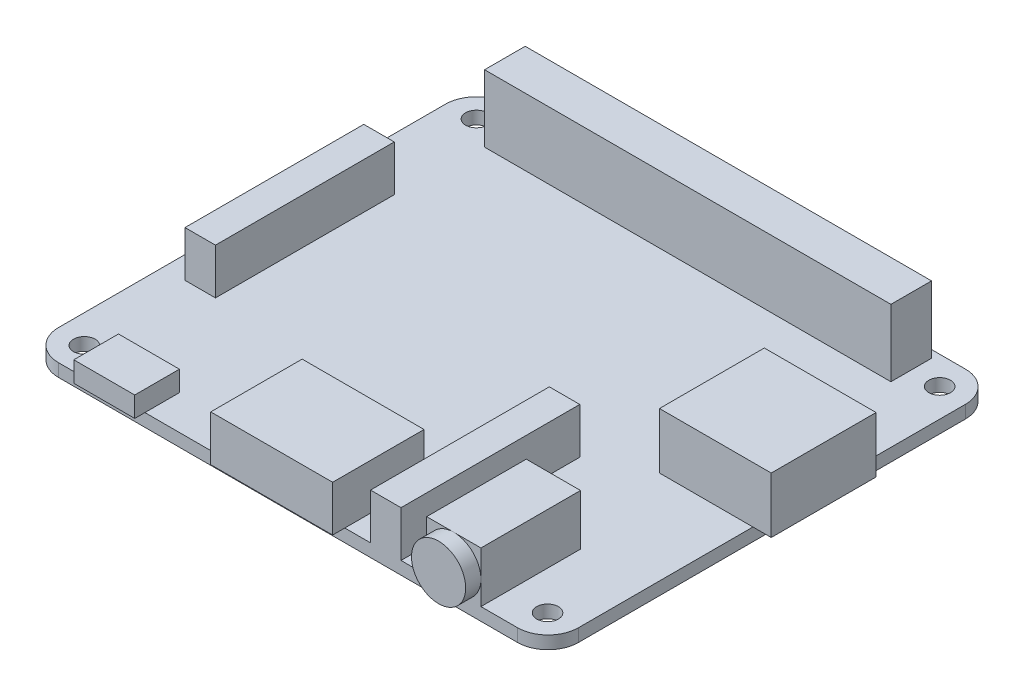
ISO-10303-21;
HEADER;
FILE_DESCRIPTION(('STEP AP214'),'2;1');
FILE_NAME('part.step','',(''),(''),'','','');
FILE_SCHEMA(('AUTOMOTIVE_DESIGN { 1 0 10303 214 1 1 1 1 }'));
ENDSEC;
DATA;
#1=APPLICATION_CONTEXT('core data for automotive mechanical design processes');
#2=APPLICATION_PROTOCOL_DEFINITION('international standard','automotive_design',2000,#1);
#3=PRODUCT_CONTEXT('',#1,'mechanical');
#4=PRODUCT('Part','Part','',(#3));
#5=PRODUCT_RELATED_PRODUCT_CATEGORY('part','',(#4));
#6=PRODUCT_DEFINITION_FORMATION('','',#4);
#7=PRODUCT_DEFINITION_CONTEXT('part definition',#1,'design');
#8=PRODUCT_DEFINITION('design','',#6,#7);
#9=PRODUCT_DEFINITION_SHAPE('','',#8);
#10=(LENGTH_UNIT() NAMED_UNIT(*) SI_UNIT(.MILLI.,.METRE.));
#11=(NAMED_UNIT(*) PLANE_ANGLE_UNIT() SI_UNIT($,.RADIAN.));
#12=(NAMED_UNIT(*) SI_UNIT($,.STERADIAN.) SOLID_ANGLE_UNIT());
#13=UNCERTAINTY_MEASURE_WITH_UNIT(LENGTH_MEASURE(1.E-05),#10,'distance_accuracy_value','');
#14=(GEOMETRIC_REPRESENTATION_CONTEXT(3) GLOBAL_UNCERTAINTY_ASSIGNED_CONTEXT((#13)) GLOBAL_UNIT_ASSIGNED_CONTEXT((#10,
#11,#12)) REPRESENTATION_CONTEXT('',''));
#15=CARTESIAN_POINT('',(0.,0.,0.));
#16=DIRECTION('',(0.,0.,1.));
#17=DIRECTION('',(1.,0.,0.));
#18=AXIS2_PLACEMENT_3D('',#15,#16,#17);
#19=CARTESIAN_POINT('',(0.,0.,0.));
#20=DIRECTION('',(0.,1.,0.));
#21=DIRECTION('',(0.,0.,1.));
#22=AXIS2_PLACEMENT_3D('',#19,#20,#21);
#23=PLANE('',#22);
#24=CARTESIAN_POINT('',(28.956,0.,-24.511));
#25=DIRECTION('',(0.,1.,0.));
#26=DIRECTION('',(0.,0.,1.));
#27=AXIS2_PLACEMENT_3D('',#24,#25,#26);
#28=CIRCLE('',#27,1.35255);
#29=CARTESIAN_POINT('',(28.956,0.,-23.15845));
#30=VERTEX_POINT('',#29);
#31=EDGE_CURVE('E596',#30,#30,#28,.T.);
#32=ORIENTED_EDGE('',*,*,#31,.T.);
#33=EDGE_LOOP('',(#32));
#34=FACE_BOUND('',#33,.T.);
#35=CARTESIAN_POINT('',(28.956,0.,24.511));
#36=DIRECTION('',(0.,1.,0.));
#37=DIRECTION('',(0.,0.,1.));
#38=AXIS2_PLACEMENT_3D('',#35,#36,#37);
#39=CIRCLE('',#38,1.35255);
#40=CARTESIAN_POINT('',(28.956,0.,25.86355));
#41=VERTEX_POINT('',#40);
#42=EDGE_CURVE('E592',#41,#41,#39,.T.);
#43=ORIENTED_EDGE('',*,*,#42,.T.);
#44=EDGE_LOOP('',(#43));
#45=FACE_BOUND('',#44,.T.);
#46=CARTESIAN_POINT('',(-28.956,0.,24.511));
#47=DIRECTION('',(0.,1.,0.));
#48=DIRECTION('',(0.,0.,1.));
#49=AXIS2_PLACEMENT_3D('',#46,#47,#48);
#50=CIRCLE('',#49,1.35255);
#51=CARTESIAN_POINT('',(-28.956,0.,25.86355));
#52=VERTEX_POINT('',#51);
#53=EDGE_CURVE('E588',#52,#52,#50,.T.);
#54=ORIENTED_EDGE('',*,*,#53,.T.);
#55=EDGE_LOOP('',(#54));
#56=FACE_BOUND('',#55,.T.);
#57=CARTESIAN_POINT('',(-28.956,0.,-24.511));
#58=DIRECTION('',(0.,1.,0.));
#59=DIRECTION('',(0.,0.,1.));
#60=AXIS2_PLACEMENT_3D('',#57,#58,#59);
#61=CIRCLE('',#60,1.35255);
#62=CARTESIAN_POINT('',(-28.956,0.,-23.15845));
#63=VERTEX_POINT('',#62);
#64=EDGE_CURVE('E584',#63,#63,#61,.T.);
#65=ORIENTED_EDGE('',*,*,#64,.T.);
#66=EDGE_LOOP('',(#65));
#67=FACE_BOUND('',#66,.T.);
#68=DIRECTION('',(1.,0.,0.));
#69=VECTOR('',#68,1.);
#70=CARTESIAN_POINT('',(-32.5,0.,-6.67099999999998));
#71=LINE('',#70,#69);
#72=CARTESIAN_POINT('',(-32.5,0.,-6.67099999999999));
#73=VERTEX_POINT('',#72);
#74=CARTESIAN_POINT('',(-18.53,0.,-6.67099999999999));
#75=VERTEX_POINT('',#74);
#76=EDGE_CURVE('E339',#73,#75,#71,.T.);
#77=ORIENTED_EDGE('',*,*,#76,.F.);
#78=DIRECTION('',(0.,0.,1.));
#79=VECTOR('',#78,1.);
#80=CARTESIAN_POINT('',(-32.5,0.,28.));
#81=LINE('',#80,#79);
#82=CARTESIAN_POINT('',(-32.5,0.,-24.19));
#83=VERTEX_POINT('',#82);
#84=EDGE_CURVE('E628',#83,#73,#81,.T.);
#85=ORIENTED_EDGE('',*,*,#84,.F.);
#86=CARTESIAN_POINT('',(-28.69,0.,-24.19));
#87=DIRECTION('',(0.,1.,0.));
#88=DIRECTION('',(0.,0.,1.));
#89=AXIS2_PLACEMENT_3D('',#86,#87,#88);
#90=CIRCLE('',#89,3.81);
#91=CARTESIAN_POINT('',(-28.69,0.,-28.));
#92=VERTEX_POINT('',#91);
#93=EDGE_CURVE('E661',#83,#92,#90,.F.);
#94=ORIENTED_EDGE('',*,*,#93,.T.);
#95=DIRECTION('',(-1.,0.,0.));
#96=VECTOR('',#95,1.);
#97=CARTESIAN_POINT('',(32.5,0.,-28.));
#98=LINE('',#97,#96);
#99=CARTESIAN_POINT('',(28.69,0.,-28.));
#100=VERTEX_POINT('',#99);
#101=EDGE_CURVE('E604',#100,#92,#98,.T.);
#102=ORIENTED_EDGE('',*,*,#101,.F.);
#103=CARTESIAN_POINT('',(28.69,0.,-24.19));
#104=DIRECTION('',(0.,1.,0.));
#105=DIRECTION('',(0.,0.,1.));
#106=AXIS2_PLACEMENT_3D('',#103,#104,#105);
#107=CIRCLE('',#106,3.81);
#108=CARTESIAN_POINT('',(32.5,0.,-24.19));
#109=VERTEX_POINT('',#108);
#110=EDGE_CURVE('E663',#100,#109,#107,.F.);
#111=ORIENTED_EDGE('',*,*,#110,.T.);
#112=DIRECTION('',(0.,0.,-1.));
#113=VECTOR('',#112,1.);
#114=CARTESIAN_POINT('',(32.5,0.,28.));
#115=LINE('',#114,#113);
#116=CARTESIAN_POINT('',(32.5,0.,24.19));
#117=VERTEX_POINT('',#116);
#118=EDGE_CURVE('E675',#117,#109,#115,.T.);
#119=ORIENTED_EDGE('',*,*,#118,.F.);
#120=CARTESIAN_POINT('',(28.69,0.,24.19));
#121=DIRECTION('',(0.,1.,0.));
#122=DIRECTION('',(0.,0.,1.));
#123=AXIS2_PLACEMENT_3D('',#120,#121,#122);
#124=CIRCLE('',#123,3.81);
#125=CARTESIAN_POINT('',(28.69,0.,28.));
#126=VERTEX_POINT('',#125);
#127=EDGE_CURVE('E668',#117,#126,#124,.F.);
#128=ORIENTED_EDGE('',*,*,#127,.T.);
#129=DIRECTION('',(1.,0.,0.));
#130=VECTOR('',#129,1.);
#131=CARTESIAN_POINT('',(32.5,0.,28.));
#132=LINE('',#131,#130);
#133=CARTESIAN_POINT('',(-28.69,0.,28.));
#134=VERTEX_POINT('',#133);
#135=EDGE_CURVE('E622',#134,#126,#132,.T.);
#136=ORIENTED_EDGE('',*,*,#135,.F.);
#137=CARTESIAN_POINT('',(-28.69,0.,24.19));
#138=DIRECTION('',(0.,1.,0.));
#139=DIRECTION('',(0.,0.,1.));
#140=AXIS2_PLACEMENT_3D('',#137,#138,#139);
#141=CIRCLE('',#140,3.81);
#142=CARTESIAN_POINT('',(-32.5,0.,24.19));
#143=VERTEX_POINT('',#142);
#144=EDGE_CURVE('E665',#134,#143,#141,.F.);
#145=ORIENTED_EDGE('',*,*,#144,.T.);
#146=CARTESIAN_POINT('',(-32.5,0.,6.41000000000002));
#147=VERTEX_POINT('',#146);
#148=EDGE_CURVE('E599',#147,#143,#81,.T.);
#149=ORIENTED_EDGE('',*,*,#148,.F.);
#150=DIRECTION('',(-1.,0.,0.));
#151=VECTOR('',#150,1.);
#152=CARTESIAN_POINT('',(-32.5,0.,6.41000000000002));
#153=LINE('',#152,#151);
#154=CARTESIAN_POINT('',(-18.53,0.,6.41000000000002));
#155=VERTEX_POINT('',#154);
#156=EDGE_CURVE('E58',#155,#147,#153,.T.);
#157=ORIENTED_EDGE('',*,*,#156,.F.);
#158=DIRECTION('',(0.,0.,1.));
#159=VECTOR('',#158,1.);
#160=CARTESIAN_POINT('',(-18.53,0.,6.41000000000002));
#161=LINE('',#160,#159);
#162=EDGE_CURVE('E53',#75,#155,#161,.T.);
#163=ORIENTED_EDGE('',*,*,#162,.F.);
#164=EDGE_LOOP('',(#77,#85,#94,#102,#111,#119,#128,#136,#145,#149,#157,#163));
#165=FACE_BOUND('',#164,.T.);
#166=ADVANCED_FACE('F35',(#34,#45,#56,#67,#165),#23,.F.);
#167=CARTESIAN_POINT('',(0.,1.6002,0.));
#168=DIRECTION('',(0.,1.,0.));
#169=DIRECTION('',(0.,0.,1.));
#170=AXIS2_PLACEMENT_3D('',#167,#168,#169);
#171=PLANE('',#170);
#172=DIRECTION('',(-1.,0.,0.));
#173=VECTOR('',#172,1.);
#174=CARTESIAN_POINT('',(-25.4,1.6002,-27.051));
#175=LINE('',#174,#173);
#176=CARTESIAN_POINT('',(25.4,1.6002,-27.051));
#177=VERTEX_POINT('',#176);
#178=CARTESIAN_POINT('',(-25.4,1.6002,-27.051));
#179=VERTEX_POINT('',#178);
#180=EDGE_CURVE('E534',#177,#179,#175,.T.);
#181=ORIENTED_EDGE('',*,*,#180,.F.);
#182=DIRECTION('',(0.,0.,-1.));
#183=VECTOR('',#182,1.);
#184=CARTESIAN_POINT('',(25.4,1.6002,-27.051));
#185=LINE('',#184,#183);
#186=CARTESIAN_POINT('',(25.4,1.6002,-21.971));
#187=VERTEX_POINT('',#186);
#188=EDGE_CURVE('E520',#187,#177,#185,.T.);
#189=ORIENTED_EDGE('',*,*,#188,.F.);
#190=DIRECTION('',(1.,0.,0.));
#191=VECTOR('',#190,1.);
#192=CARTESIAN_POINT('',(-25.4,1.6002,-21.971));
#193=LINE('',#192,#191);
#194=CARTESIAN_POINT('',(-25.4,1.6002,-21.971));
#195=VERTEX_POINT('',#194);
#196=EDGE_CURVE('E525',#195,#187,#193,.T.);
#197=ORIENTED_EDGE('',*,*,#196,.F.);
#198=DIRECTION('',(0.,0.,1.));
#199=VECTOR('',#198,1.);
#200=CARTESIAN_POINT('',(-25.4,1.6002,-27.051));
#201=LINE('',#200,#199);
#202=EDGE_CURVE('E536',#179,#195,#201,.T.);
#203=ORIENTED_EDGE('',*,*,#202,.F.);
#204=EDGE_LOOP('',(#181,#189,#197,#203));
#205=FACE_BOUND('',#204,.T.);
#206=CARTESIAN_POINT('',(-28.956,1.6002,-24.511));
#207=DIRECTION('',(0.,1.,0.));
#208=DIRECTION('',(0.,0.,1.));
#209=AXIS2_PLACEMENT_3D('',#206,#207,#208);
#210=CIRCLE('',#209,1.35255);
#211=CARTESIAN_POINT('',(-28.956,1.6002,-23.15845));
#212=VERTEX_POINT('',#211);
#213=EDGE_CURVE('E581',#212,#212,#210,.T.);
#214=ORIENTED_EDGE('',*,*,#213,.F.);
#215=EDGE_LOOP('',(#214));
#216=FACE_BOUND('',#215,.T.);
#217=CARTESIAN_POINT('',(-28.956,1.6002,24.511));
#218=DIRECTION('',(0.,1.,0.));
#219=DIRECTION('',(0.,0.,1.));
#220=AXIS2_PLACEMENT_3D('',#217,#218,#219);
#221=CIRCLE('',#220,1.35255);
#222=CARTESIAN_POINT('',(-28.956,1.6002,25.86355));
#223=VERTEX_POINT('',#222);
#224=EDGE_CURVE('E585',#223,#223,#221,.T.);
#225=ORIENTED_EDGE('',*,*,#224,.F.);
#226=EDGE_LOOP('',(#225));
#227=FACE_BOUND('',#226,.T.);
#228=CARTESIAN_POINT('',(28.956,1.6002,24.511));
#229=DIRECTION('',(0.,1.,0.));
#230=DIRECTION('',(0.,0.,1.));
#231=AXIS2_PLACEMENT_3D('',#228,#229,#230);
#232=CIRCLE('',#231,1.35255);
#233=CARTESIAN_POINT('',(28.956,1.6002,25.86355));
#234=VERTEX_POINT('',#233);
#235=EDGE_CURVE('E589',#234,#234,#232,.T.);
#236=ORIENTED_EDGE('',*,*,#235,.F.);
#237=EDGE_LOOP('',(#236));
#238=FACE_BOUND('',#237,.T.);
#239=CARTESIAN_POINT('',(28.956,1.6002,-24.511));
#240=DIRECTION('',(0.,1.,0.));
#241=DIRECTION('',(0.,0.,1.));
#242=AXIS2_PLACEMENT_3D('',#239,#240,#241);
#243=CIRCLE('',#242,1.35255);
#244=CARTESIAN_POINT('',(28.956,1.6002,-23.15845));
#245=VERTEX_POINT('',#244);
#246=EDGE_CURVE('E593',#245,#245,#243,.T.);
#247=ORIENTED_EDGE('',*,*,#246,.F.);
#248=EDGE_LOOP('',(#247));
#249=FACE_BOUND('',#248,.T.);
#250=DIRECTION('',(-1.,0.,0.));
#251=VECTOR('',#250,1.);
#252=CARTESIAN_POINT('',(-29.706,1.6002,-11.176));
#253=LINE('',#252,#251);
#254=CARTESIAN_POINT('',(-25.896,1.6002,-11.176));
#255=VERTEX_POINT('',#254);
#256=CARTESIAN_POINT('',(-29.706,1.6002,-11.176));
#257=VERTEX_POINT('',#256);
#258=EDGE_CURVE('E505',#255,#257,#253,.T.);
#259=ORIENTED_EDGE('',*,*,#258,.F.);
#260=DIRECTION('',(0.,0.,-1.));
#261=VECTOR('',#260,1.);
#262=CARTESIAN_POINT('',(-25.896,1.6002,-11.176));
#263=LINE('',#262,#261);
#264=CARTESIAN_POINT('',(-25.896,1.6002,11.176));
#265=VERTEX_POINT('',#264);
#266=EDGE_CURVE('E491',#265,#255,#263,.T.);
#267=ORIENTED_EDGE('',*,*,#266,.F.);
#268=DIRECTION('',(1.,0.,0.));
#269=VECTOR('',#268,1.);
#270=CARTESIAN_POINT('',(-29.706,1.6002,11.176));
#271=LINE('',#270,#269);
#272=CARTESIAN_POINT('',(-29.706,1.6002,11.176));
#273=VERTEX_POINT('',#272);
#274=EDGE_CURVE('E496',#273,#265,#271,.T.);
#275=ORIENTED_EDGE('',*,*,#274,.F.);
#276=DIRECTION('',(0.,0.,1.));
#277=VECTOR('',#276,1.);
#278=CARTESIAN_POINT('',(-29.706,1.6002,-11.176));
#279=LINE('',#278,#277);
#280=EDGE_CURVE('E507',#257,#273,#279,.T.);
#281=ORIENTED_EDGE('',*,*,#280,.F.);
#282=EDGE_LOOP('',(#259,#267,#275,#281));
#283=FACE_BOUND('',#282,.T.);
#284=DIRECTION('',(1.,0.,0.));
#285=VECTOR('',#284,1.);
#286=CARTESIAN_POINT('',(32.5,1.6002,28.));
#287=LINE('',#286,#285);
#288=CARTESIAN_POINT('',(-28.69,1.6002,28.));
#289=VERTEX_POINT('',#288);
#290=CARTESIAN_POINT('',(-25.515,1.6002,28.));
#291=VERTEX_POINT('',#290);
#292=EDGE_CURVE('E605',#289,#291,#287,.T.);
#293=ORIENTED_EDGE('',*,*,#292,.T.);
#294=DIRECTION('',(0.,0.,1.));
#295=VECTOR('',#294,1.);
#296=CARTESIAN_POINT('',(-25.515,1.6002,23.682));
#297=LINE('',#296,#295);
#298=CARTESIAN_POINT('',(-25.515,1.6002,23.682));
#299=VERTEX_POINT('',#298);
#300=EDGE_CURVE('E344',#299,#291,#297,.T.);
#301=ORIENTED_EDGE('',*,*,#300,.F.);
#302=DIRECTION('',(-1.,0.,0.));
#303=VECTOR('',#302,1.);
#304=CARTESIAN_POINT('',(-25.515,1.6002,23.682));
#305=LINE('',#304,#303);
#306=CARTESIAN_POINT('',(-17.895,1.6002,23.682));
#307=VERTEX_POINT('',#306);
#308=EDGE_CURVE('E356',#307,#299,#305,.T.);
#309=ORIENTED_EDGE('',*,*,#308,.F.);
#310=DIRECTION('',(0.,0.,-1.));
#311=VECTOR('',#310,1.);
#312=CARTESIAN_POINT('',(-17.895,1.6002,23.682));
#313=LINE('',#312,#311);
#314=CARTESIAN_POINT('',(-17.895,1.6002,28.));
#315=VERTEX_POINT('',#314);
#316=EDGE_CURVE('E366',#315,#307,#313,.T.);
#317=ORIENTED_EDGE('',*,*,#316,.F.);
#318=CARTESIAN_POINT('',(-8.14,1.6002,28.));
#319=VERTEX_POINT('',#318);
#320=EDGE_CURVE('E610',#315,#319,#287,.T.);
#321=ORIENTED_EDGE('',*,*,#320,.T.);
#322=DIRECTION('',(0.,0.,1.));
#323=VECTOR('',#322,1.);
#324=CARTESIAN_POINT('',(-8.14,1.6002,18.094));
#325=LINE('',#324,#323);
#326=CARTESIAN_POINT('',(-8.14,1.6002,18.094));
#327=VERTEX_POINT('',#326);
#328=EDGE_CURVE('E476',#327,#319,#325,.T.);
#329=ORIENTED_EDGE('',*,*,#328,.F.);
#330=DIRECTION('',(-1.,0.,0.));
#331=VECTOR('',#330,1.);
#332=CARTESIAN_POINT('',(-8.14,1.6002,18.094));
#333=LINE('',#332,#331);
#334=CARTESIAN_POINT('',(7.1,1.6002,18.094));
#335=VERTEX_POINT('',#334);
#336=EDGE_CURVE('E472',#335,#327,#333,.T.);
#337=ORIENTED_EDGE('',*,*,#336,.F.);
#338=DIRECTION('',(0.,0.,-1.));
#339=VECTOR('',#338,1.);
#340=CARTESIAN_POINT('',(7.1,1.6002,18.094));
#341=LINE('',#340,#339);
#342=CARTESIAN_POINT('',(7.1,1.6002,28.));
#343=VERTEX_POINT('',#342);
#344=EDGE_CURVE('E457',#343,#335,#341,.T.);
#345=ORIENTED_EDGE('',*,*,#344,.F.);
#346=CARTESIAN_POINT('',(10.3131,1.6002,28.));
#347=VERTEX_POINT('',#346);
#348=EDGE_CURVE('E1312',#343,#347,#287,.T.);
#349=ORIENTED_EDGE('',*,*,#348,.T.);
#350=DIRECTION('',(0.,0.,1.));
#351=VECTOR('',#350,1.);
#352=CARTESIAN_POINT('',(10.3131,1.6002,5.64800000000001));
#353=LINE('',#352,#351);
#354=CARTESIAN_POINT('',(10.3131,1.6002,5.64800000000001));
#355=VERTEX_POINT('',#354);
#356=EDGE_CURVE('E384',#355,#347,#353,.T.);
#357=ORIENTED_EDGE('',*,*,#356,.F.);
#358=DIRECTION('',(-1.,0.,0.));
#359=VECTOR('',#358,1.);
#360=CARTESIAN_POINT('',(10.3131,1.6002,5.64800000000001));
#361=LINE('',#360,#359);
#362=CARTESIAN_POINT('',(14.1231,1.6002,5.64800000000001));
#363=VERTEX_POINT('',#362);
#364=EDGE_CURVE('E389',#363,#355,#361,.T.);
#365=ORIENTED_EDGE('',*,*,#364,.F.);
#366=DIRECTION('',(0.,0.,-1.));
#367=VECTOR('',#366,1.);
#368=CARTESIAN_POINT('',(14.1231,1.6002,5.64800000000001));
#369=LINE('',#368,#367);
#370=CARTESIAN_POINT('',(14.1231,1.6002,28.));
#371=VERTEX_POINT('',#370);
#372=EDGE_CURVE('E393',#371,#363,#369,.T.);
#373=ORIENTED_EDGE('',*,*,#372,.F.);
#374=CARTESIAN_POINT('',(17.3362,1.6002,28.));
#375=VERTEX_POINT('',#374);
#376=EDGE_CURVE('E1308',#371,#375,#287,.T.);
#377=ORIENTED_EDGE('',*,*,#376,.T.);
#378=DIRECTION('',(0.,0.,1.));
#379=VECTOR('',#378,1.);
#380=CARTESIAN_POINT('',(17.3362,1.6002,15.554));
#381=LINE('',#380,#379);
#382=CARTESIAN_POINT('',(17.3362,1.6002,15.554));
#383=VERTEX_POINT('',#382);
#384=EDGE_CURVE('E429',#383,#375,#381,.T.);
#385=ORIENTED_EDGE('',*,*,#384,.F.);
#386=DIRECTION('',(-1.,0.,0.));
#387=VECTOR('',#386,1.);
#388=CARTESIAN_POINT('',(17.3362,1.6002,15.554));
#389=LINE('',#388,#387);
#390=CARTESIAN_POINT('',(24.118,1.6002,15.554));
#391=VERTEX_POINT('',#390);
#392=EDGE_CURVE('E440',#391,#383,#389,.T.);
#393=ORIENTED_EDGE('',*,*,#392,.F.);
#394=DIRECTION('',(0.,0.,-1.));
#395=VECTOR('',#394,1.);
#396=CARTESIAN_POINT('',(24.118,1.6002,15.554));
#397=LINE('',#396,#395);
#398=CARTESIAN_POINT('',(24.118,1.6002,28.));
#399=VERTEX_POINT('',#398);
#400=EDGE_CURVE('E420',#399,#391,#397,.T.);
#401=ORIENTED_EDGE('',*,*,#400,.F.);
#402=CARTESIAN_POINT('',(28.69,1.6002,28.));
#403=VERTEX_POINT('',#402);
#404=EDGE_CURVE('E603',#399,#403,#287,.T.);
#405=ORIENTED_EDGE('',*,*,#404,.T.);
#406=CARTESIAN_POINT('',(28.69,1.6002,24.19));
#407=DIRECTION('',(0.,1.,0.));
#408=DIRECTION('',(0.,0.,1.));
#409=AXIS2_PLACEMENT_3D('',#406,#407,#408);
#410=CIRCLE('',#409,3.81);
#411=CARTESIAN_POINT('',(32.5,1.6002,24.19));
#412=VERTEX_POINT('',#411);
#413=EDGE_CURVE('E654',#403,#412,#410,.T.);
#414=ORIENTED_EDGE('',*,*,#413,.T.);
#415=DIRECTION('',(0.,0.,-1.));
#416=VECTOR('',#415,1.);
#417=CARTESIAN_POINT('',(32.5,1.6002,28.));
#418=LINE('',#417,#416);
#419=CARTESIAN_POINT('',(32.5,1.6002,2.37840000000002));
#420=VERTEX_POINT('',#419);
#421=EDGE_CURVE('E612',#412,#420,#418,.T.);
#422=ORIENTED_EDGE('',*,*,#421,.T.);
#423=DIRECTION('',(1.,0.,0.));
#424=VECTOR('',#423,1.);
#425=CARTESIAN_POINT('',(20.816,1.6002,2.37840000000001));
#426=LINE('',#425,#424);
#427=CARTESIAN_POINT('',(20.816,1.6002,2.37840000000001));
#428=VERTEX_POINT('',#427);
#429=EDGE_CURVE('E554',#428,#420,#426,.T.);
#430=ORIENTED_EDGE('',*,*,#429,.F.);
#431=DIRECTION('',(0.,0.,1.));
#432=VECTOR('',#431,1.);
#433=CARTESIAN_POINT('',(20.816,1.6002,-10.728));
#434=LINE('',#433,#432);
#435=CARTESIAN_POINT('',(20.816,1.6002,-10.728));
#436=VERTEX_POINT('',#435);
#437=EDGE_CURVE('E564',#436,#428,#434,.T.);
#438=ORIENTED_EDGE('',*,*,#437,.F.);
#439=DIRECTION('',(-1.,0.,0.));
#440=VECTOR('',#439,1.);
#441=CARTESIAN_POINT('',(20.816,1.6002,-10.728));
#442=LINE('',#441,#440);
#443=CARTESIAN_POINT('',(32.5,1.6002,-10.728));
#444=VERTEX_POINT('',#443);
#445=EDGE_CURVE('E11',#444,#436,#442,.T.);
#446=ORIENTED_EDGE('',*,*,#445,.F.);
#447=CARTESIAN_POINT('',(32.5,1.6002,-24.19));
#448=VERTEX_POINT('',#447);
#449=EDGE_CURVE('E608',#444,#448,#418,.T.);
#450=ORIENTED_EDGE('',*,*,#449,.T.);
#451=CARTESIAN_POINT('',(28.69,1.6002,-24.19));
#452=DIRECTION('',(0.,1.,0.));
#453=DIRECTION('',(0.,0.,1.));
#454=AXIS2_PLACEMENT_3D('',#451,#452,#453);
#455=CIRCLE('',#454,3.81);
#456=CARTESIAN_POINT('',(28.69,1.6002,-28.));
#457=VERTEX_POINT('',#456);
#458=EDGE_CURVE('E650',#448,#457,#455,.T.);
#459=ORIENTED_EDGE('',*,*,#458,.T.);
#460=DIRECTION('',(-1.,0.,0.));
#461=VECTOR('',#460,1.);
#462=CARTESIAN_POINT('',(32.5,1.6002,-28.));
#463=LINE('',#462,#461);
#464=CARTESIAN_POINT('',(-28.69,1.6002,-28.));
#465=VERTEX_POINT('',#464);
#466=EDGE_CURVE('E615',#457,#465,#463,.T.);
#467=ORIENTED_EDGE('',*,*,#466,.T.);
#468=CARTESIAN_POINT('',(-28.69,1.6002,-24.19));
#469=DIRECTION('',(0.,1.,0.));
#470=DIRECTION('',(0.,0.,1.));
#471=AXIS2_PLACEMENT_3D('',#468,#469,#470);
#472=CIRCLE('',#471,3.81);
#473=CARTESIAN_POINT('',(-32.5,1.6002,-24.19));
#474=VERTEX_POINT('',#473);
#475=EDGE_CURVE('E648',#465,#474,#472,.T.);
#476=ORIENTED_EDGE('',*,*,#475,.T.);
#477=DIRECTION('',(0.,0.,1.));
#478=VECTOR('',#477,1.);
#479=CARTESIAN_POINT('',(-32.5,1.6002,28.));
#480=LINE('',#479,#478);
#481=CARTESIAN_POINT('',(-32.5,1.6002,24.19));
#482=VERTEX_POINT('',#481);
#483=EDGE_CURVE('E600',#474,#482,#480,.T.);
#484=ORIENTED_EDGE('',*,*,#483,.T.);
#485=CARTESIAN_POINT('',(-28.69,1.6002,24.19));
#486=DIRECTION('',(0.,1.,0.));
#487=DIRECTION('',(0.,0.,1.));
#488=AXIS2_PLACEMENT_3D('',#485,#486,#487);
#489=CIRCLE('',#488,3.81);
#490=EDGE_CURVE('E652',#482,#289,#489,.T.);
#491=ORIENTED_EDGE('',*,*,#490,.T.);
#492=EDGE_LOOP('',(#293,#301,#309,#317,#321,#329,#337,#345,#349,#357,#365,#373,#377,#385,#393,
#401,#405,#414,#422,#430,#438,#446,#450,#459,#467,#476,#484,#491));
#493=FACE_BOUND('',#492,.T.);
#494=ADVANCED_FACE('F694',(#205,#216,#227,#238,#249,#283,#493),#171,.T.);
#495=CARTESIAN_POINT('',(32.5,1.6002,28.));
#496=DIRECTION('',(0.,0.,-1.));
#497=DIRECTION('',(-1.,0.,0.));
#498=AXIS2_PLACEMENT_3D('',#495,#496,#497);
#499=PLANE('',#498);
#500=CARTESIAN_POINT('',(20.7271,4.5593,28.));
#501=DIRECTION('',(0.,0.,1.));
#502=DIRECTION('',(1.,0.,0.));
#503=AXIS2_PLACEMENT_3D('',#500,#501,#502);
#504=CIRCLE('',#503,3.3909);
#505=CARTESIAN_POINT('',(17.3362,4.5593,28.));
#506=VERTEX_POINT('',#505);
#507=CARTESIAN_POINT('',(24.118,4.5593,28.));
#508=VERTEX_POINT('',#507);
#509=EDGE_CURVE('E399',#506,#508,#504,.T.);
#510=ORIENTED_EDGE('',*,*,#509,.F.);
#511=DIRECTION('',(0.,-1.,0.));
#512=VECTOR('',#511,1.);
#513=CARTESIAN_POINT('',(17.3362,7.9502,28.));
#514=LINE('',#513,#512);
#515=EDGE_CURVE('E448',#506,#375,#514,.T.);
#516=ORIENTED_EDGE('',*,*,#515,.T.);
#517=ORIENTED_EDGE('',*,*,#376,.F.);
#518=DIRECTION('',(0.,-1.,0.));
#519=VECTOR('',#518,1.);
#520=CARTESIAN_POINT('',(14.1231,29.9895909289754,28.));
#521=LINE('',#520,#519);
#522=CARTESIAN_POINT('',(14.1231,7.3152,28.));
#523=VERTEX_POINT('',#522);
#524=EDGE_CURVE('E383',#523,#371,#521,.T.);
#525=ORIENTED_EDGE('',*,*,#524,.F.);
#526=DIRECTION('',(1.,0.,0.));
#527=VECTOR('',#526,1.);
#528=CARTESIAN_POINT('',(10.3131,7.3152,28.));
#529=LINE('',#528,#527);
#530=CARTESIAN_POINT('',(10.3131,7.3152,28.));
#531=VERTEX_POINT('',#530);
#532=EDGE_CURVE('E406',#531,#523,#529,.T.);
#533=ORIENTED_EDGE('',*,*,#532,.F.);
#534=DIRECTION('',(0.,-1.,0.));
#535=VECTOR('',#534,1.);
#536=CARTESIAN_POINT('',(10.3131,29.9895909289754,28.));
#537=LINE('',#536,#535);
#538=EDGE_CURVE('E387',#531,#347,#537,.T.);
#539=ORIENTED_EDGE('',*,*,#538,.T.);
#540=ORIENTED_EDGE('',*,*,#348,.F.);
#541=EDGE_CURVE('E611',#319,#343,#287,.T.);
#542=ORIENTED_EDGE('',*,*,#541,.F.);
#543=ORIENTED_EDGE('',*,*,#320,.F.);
#544=EDGE_CURVE('E609',#291,#315,#287,.T.);
#545=ORIENTED_EDGE('',*,*,#544,.F.);
#546=ORIENTED_EDGE('',*,*,#292,.F.);
#547=DIRECTION('',(0.,-1.,0.));
#548=VECTOR('',#547,1.);
#549=CARTESIAN_POINT('',(-28.69,1.6002,28.));
#550=LINE('',#549,#548);
#551=EDGE_CURVE('E44',#289,#134,#550,.T.);
#552=ORIENTED_EDGE('',*,*,#551,.T.);
#553=ORIENTED_EDGE('',*,*,#135,.T.);
#554=DIRECTION('',(0.,-1.,0.));
#555=VECTOR('',#554,1.);
#556=CARTESIAN_POINT('',(28.69,1.6002,28.));
#557=LINE('',#556,#555);
#558=EDGE_CURVE('E639',#126,#403,#557,.F.);
#559=ORIENTED_EDGE('',*,*,#558,.T.);
#560=ORIENTED_EDGE('',*,*,#404,.F.);
#561=DIRECTION('',(0.,-1.,0.));
#562=VECTOR('',#561,1.);
#563=CARTESIAN_POINT('',(24.118,7.9502,28.));
#564=LINE('',#563,#562);
#565=EDGE_CURVE('E437',#508,#399,#564,.T.);
#566=ORIENTED_EDGE('',*,*,#565,.F.);
#567=EDGE_LOOP('',(#510,#516,#517,#525,#533,#539,#540,#542,#543,#545,#546,#552,#553,#559,#560,#566));
#568=FACE_BOUND('',#567,.T.);
#569=ADVANCED_FACE('F685',(#568),#499,.F.);
#570=CARTESIAN_POINT('',(20.7271,7.9502,28.));
#571=VERTEX_POINT('',#570);
#572=EDGE_CURVE('E421',#508,#571,#504,.T.);
#573=ORIENTED_EDGE('',*,*,#572,.F.);
#574=CARTESIAN_POINT('',(24.118,7.9502,28.));
#575=VERTEX_POINT('',#574);
#576=EDGE_CURVE('E445',#575,#508,#564,.T.);
#577=ORIENTED_EDGE('',*,*,#576,.F.);
#578=DIRECTION('',(1.,0.,0.));
#579=VECTOR('',#578,1.);
#580=CARTESIAN_POINT('',(17.3362,7.9502,28.));
#581=LINE('',#580,#579);
#582=EDGE_CURVE('E433',#571,#575,#581,.T.);
#583=ORIENTED_EDGE('',*,*,#582,.F.);
#584=EDGE_LOOP('',(#573,#577,#583));
#585=FACE_BOUND('',#584,.T.);
#586=ADVANCED_FACE('F760',(#585),#499,.F.);
#587=EDGE_CURVE('E424',#571,#506,#504,.T.);
#588=ORIENTED_EDGE('',*,*,#587,.F.);
#589=CARTESIAN_POINT('',(17.3362,7.9502,28.));
#590=VERTEX_POINT('',#589);
#591=EDGE_CURVE('E434',#590,#571,#581,.T.);
#592=ORIENTED_EDGE('',*,*,#591,.F.);
#593=EDGE_CURVE('E449',#590,#506,#514,.T.);
#594=ORIENTED_EDGE('',*,*,#593,.T.);
#595=EDGE_LOOP('',(#588,#592,#594));
#596=FACE_BOUND('',#595,.T.);
#597=ADVANCED_FACE('F761',(#596),#499,.F.);
#598=CARTESIAN_POINT('',(-32.5,1.6002,28.));
#599=DIRECTION('',(1.,0.,0.));
#600=DIRECTION('',(0.,0.,-1.));
#601=AXIS2_PLACEMENT_3D('',#598,#599,#600);
#602=PLANE('',#601);
#603=ORIENTED_EDGE('',*,*,#483,.F.);
#604=DIRECTION('',(0.,-1.,0.));
#605=VECTOR('',#604,1.);
#606=CARTESIAN_POINT('',(-32.5,1.6002,-24.19));
#607=LINE('',#606,#605);
#608=EDGE_CURVE('E670',#474,#83,#607,.T.);
#609=ORIENTED_EDGE('',*,*,#608,.T.);
#610=ORIENTED_EDGE('',*,*,#84,.T.);
#611=DIRECTION('',(0.,1.,0.));
#612=VECTOR('',#611,1.);
#613=CARTESIAN_POINT('',(-32.5,-1.27,-6.67099999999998));
#614=LINE('',#613,#612);
#615=CARTESIAN_POINT('',(-32.5,-1.27,-6.67099999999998));
#616=VERTEX_POINT('',#615);
#617=EDGE_CURVE('E346',#616,#73,#614,.T.);
#618=ORIENTED_EDGE('',*,*,#617,.F.);
#619=DIRECTION('',(0.,0.,-1.));
#620=VECTOR('',#619,1.);
#621=CARTESIAN_POINT('',(-32.5,-1.27,6.41000000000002));
#622=LINE('',#621,#620);
#623=CARTESIAN_POINT('',(-32.5,-1.27,6.41000000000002));
#624=VERTEX_POINT('',#623);
#625=EDGE_CURVE('E329',#624,#616,#622,.T.);
#626=ORIENTED_EDGE('',*,*,#625,.F.);
#627=DIRECTION('',(0.,1.,0.));
#628=VECTOR('',#627,1.);
#629=CARTESIAN_POINT('',(-32.5,-1.27,6.41000000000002));
#630=LINE('',#629,#628);
#631=EDGE_CURVE('E326',#624,#147,#630,.T.);
#632=ORIENTED_EDGE('',*,*,#631,.T.);
#633=ORIENTED_EDGE('',*,*,#148,.T.);
#634=DIRECTION('',(0.,-1.,0.));
#635=VECTOR('',#634,1.);
#636=CARTESIAN_POINT('',(-32.5,1.6002,24.19));
#637=LINE('',#636,#635);
#638=EDGE_CURVE('E619',#143,#482,#637,.F.);
#639=ORIENTED_EDGE('',*,*,#638,.T.);
#640=EDGE_LOOP('',(#603,#609,#610,#618,#626,#632,#633,#639));
#641=FACE_BOUND('',#640,.T.);
#642=ADVANCED_FACE('F717',(#641),#602,.F.);
#643=CARTESIAN_POINT('',(32.5,1.6002,28.));
#644=DIRECTION('',(-1.,0.,0.));
#645=DIRECTION('',(0.,0.,1.));
#646=AXIS2_PLACEMENT_3D('',#643,#644,#645);
#647=PLANE('',#646);
#648=ORIENTED_EDGE('',*,*,#118,.T.);
#649=DIRECTION('',(0.,-1.,0.));
#650=VECTOR('',#649,1.);
#651=CARTESIAN_POINT('',(32.5,1.6002,-24.19));
#652=LINE('',#651,#650);
#653=EDGE_CURVE('E642',#109,#448,#652,.F.);
#654=ORIENTED_EDGE('',*,*,#653,.T.);
#655=ORIENTED_EDGE('',*,*,#449,.F.);
#656=EDGE_CURVE('E616',#420,#444,#418,.T.);
#657=ORIENTED_EDGE('',*,*,#656,.F.);
#658=ORIENTED_EDGE('',*,*,#421,.F.);
#659=DIRECTION('',(0.,-1.,0.));
#660=VECTOR('',#659,1.);
#661=CARTESIAN_POINT('',(32.5,1.6002,24.19));
#662=LINE('',#661,#660);
#663=EDGE_CURVE('E645',#412,#117,#662,.T.);
#664=ORIENTED_EDGE('',*,*,#663,.T.);
#665=EDGE_LOOP('',(#648,#654,#655,#657,#658,#664));
#666=FACE_BOUND('',#665,.T.);
#667=ADVANCED_FACE('F697',(#666),#647,.F.);
#668=CARTESIAN_POINT('',(32.5,1.6002,-28.));
#669=DIRECTION('',(0.,0.,1.));
#670=DIRECTION('',(1.,0.,0.));
#671=AXIS2_PLACEMENT_3D('',#668,#669,#670);
#672=PLANE('',#671);
#673=ORIENTED_EDGE('',*,*,#101,.T.);
#674=DIRECTION('',(0.,-1.,0.));
#675=VECTOR('',#674,1.);
#676=CARTESIAN_POINT('',(-28.69,1.6002,-28.));
#677=LINE('',#676,#675);
#678=EDGE_CURVE('E656',#92,#465,#677,.F.);
#679=ORIENTED_EDGE('',*,*,#678,.T.);
#680=ORIENTED_EDGE('',*,*,#466,.F.);
#681=DIRECTION('',(0.,-1.,0.));
#682=VECTOR('',#681,1.);
#683=CARTESIAN_POINT('',(28.69,1.6002,-28.));
#684=LINE('',#683,#682);
#685=EDGE_CURVE('E658',#457,#100,#684,.T.);
#686=ORIENTED_EDGE('',*,*,#685,.T.);
#687=EDGE_LOOP('',(#673,#679,#680,#686));
#688=FACE_BOUND('',#687,.T.);
#689=ADVANCED_FACE('F708',(#688),#672,.F.);
#690=CARTESIAN_POINT('',(-28.69,1.6002,-24.19));
#691=DIRECTION('',(0.,-1.,0.));
#692=DIRECTION('',(0.,0.,-1.));
#693=AXIS2_PLACEMENT_3D('',#690,#691,#692);
#694=CYLINDRICAL_SURFACE('',#693,3.81);
#695=ORIENTED_EDGE('',*,*,#475,.F.);
#696=ORIENTED_EDGE('',*,*,#678,.F.);
#697=ORIENTED_EDGE('',*,*,#93,.F.);
#698=ORIENTED_EDGE('',*,*,#608,.F.);
#699=EDGE_LOOP('',(#695,#696,#697,#698));
#700=FACE_BOUND('',#699,.T.);
#701=ADVANCED_FACE('F714',(#700),#694,.T.);
#702=CARTESIAN_POINT('',(28.69,1.6002,-24.19));
#703=DIRECTION('',(0.,-1.,0.));
#704=DIRECTION('',(0.,0.,-1.));
#705=AXIS2_PLACEMENT_3D('',#702,#703,#704);
#706=CYLINDRICAL_SURFACE('',#705,3.81);
#707=ORIENTED_EDGE('',*,*,#458,.F.);
#708=ORIENTED_EDGE('',*,*,#653,.F.);
#709=ORIENTED_EDGE('',*,*,#110,.F.);
#710=ORIENTED_EDGE('',*,*,#685,.F.);
#711=EDGE_LOOP('',(#707,#708,#709,#710));
#712=FACE_BOUND('',#711,.T.);
#713=ADVANCED_FACE('F705',(#712),#706,.T.);
#714=CARTESIAN_POINT('',(-28.69,1.6002,24.19));
#715=DIRECTION('',(0.,-1.,0.));
#716=DIRECTION('',(0.,0.,-1.));
#717=AXIS2_PLACEMENT_3D('',#714,#715,#716);
#718=CYLINDRICAL_SURFACE('',#717,3.81);
#719=ORIENTED_EDGE('',*,*,#490,.F.);
#720=ORIENTED_EDGE('',*,*,#638,.F.);
#721=ORIENTED_EDGE('',*,*,#144,.F.);
#722=ORIENTED_EDGE('',*,*,#551,.F.);
#723=EDGE_LOOP('',(#719,#720,#721,#722));
#724=FACE_BOUND('',#723,.T.);
#725=ADVANCED_FACE('F723',(#724),#718,.T.);
#726=CARTESIAN_POINT('',(28.69,1.6002,24.19));
#727=DIRECTION('',(0.,-1.,0.));
#728=DIRECTION('',(0.,0.,-1.));
#729=AXIS2_PLACEMENT_3D('',#726,#727,#728);
#730=CYLINDRICAL_SURFACE('',#729,3.81);
#731=ORIENTED_EDGE('',*,*,#413,.F.);
#732=ORIENTED_EDGE('',*,*,#558,.F.);
#733=ORIENTED_EDGE('',*,*,#127,.F.);
#734=ORIENTED_EDGE('',*,*,#663,.F.);
#735=EDGE_LOOP('',(#731,#732,#733,#734));
#736=FACE_BOUND('',#735,.T.);
#737=ADVANCED_FACE('F37',(#736),#730,.T.);
#738=CARTESIAN_POINT('',(28.956,1.6002,-24.511));
#739=DIRECTION('',(0.,1.,0.));
#740=DIRECTION('',(0.,0.,1.));
#741=AXIS2_PLACEMENT_3D('',#738,#739,#740);
#742=CYLINDRICAL_SURFACE('',#741,1.35255);
#743=ORIENTED_EDGE('',*,*,#246,.T.);
#744=EDGE_LOOP('',(#743));
#745=FACE_BOUND('',#744,.T.);
#746=ORIENTED_EDGE('',*,*,#31,.F.);
#747=EDGE_LOOP('',(#746));
#748=FACE_BOUND('',#747,.T.);
#749=ADVANCED_FACE('F771',(#745,#748),#742,.F.);
#750=CARTESIAN_POINT('',(28.956,1.6002,24.511));
#751=DIRECTION('',(0.,1.,0.));
#752=DIRECTION('',(0.,0.,1.));
#753=AXIS2_PLACEMENT_3D('',#750,#751,#752);
#754=CYLINDRICAL_SURFACE('',#753,1.35255);
#755=ORIENTED_EDGE('',*,*,#235,.T.);
#756=EDGE_LOOP('',(#755));
#757=FACE_BOUND('',#756,.T.);
#758=ORIENTED_EDGE('',*,*,#42,.F.);
#759=EDGE_LOOP('',(#758));
#760=FACE_BOUND('',#759,.T.);
#761=ADVANCED_FACE('F775',(#757,#760),#754,.F.);
#762=CARTESIAN_POINT('',(-28.956,1.6002,24.511));
#763=DIRECTION('',(0.,1.,0.));
#764=DIRECTION('',(0.,0.,1.));
#765=AXIS2_PLACEMENT_3D('',#762,#763,#764);
#766=CYLINDRICAL_SURFACE('',#765,1.35255);
#767=ORIENTED_EDGE('',*,*,#224,.T.);
#768=EDGE_LOOP('',(#767));
#769=FACE_BOUND('',#768,.T.);
#770=ORIENTED_EDGE('',*,*,#53,.F.);
#771=EDGE_LOOP('',(#770));
#772=FACE_BOUND('',#771,.T.);
#773=ADVANCED_FACE('F780',(#769,#772),#766,.F.);
#774=CARTESIAN_POINT('',(-28.956,1.6002,-24.511));
#775=DIRECTION('',(0.,1.,0.));
#776=DIRECTION('',(0.,0.,1.));
#777=AXIS2_PLACEMENT_3D('',#774,#775,#776);
#778=CYLINDRICAL_SURFACE('',#777,1.35255);
#779=ORIENTED_EDGE('',*,*,#213,.T.);
#780=EDGE_LOOP('',(#779));
#781=FACE_BOUND('',#780,.T.);
#782=ORIENTED_EDGE('',*,*,#64,.F.);
#783=EDGE_LOOP('',(#782));
#784=FACE_BOUND('',#783,.T.);
#785=ADVANCED_FACE('F787',(#781,#784),#778,.F.);
#786=CARTESIAN_POINT('',(0.,1.6002,0.));
#787=DIRECTION('',(0.,1.,0.));
#788=DIRECTION('',(0.,0.,1.));
#789=AXIS2_PLACEMENT_3D('',#786,#787,#788);
#790=PLANE('',#789);
#791=CARTESIAN_POINT('',(34.786,1.6002,2.37840000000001));
#792=VERTEX_POINT('',#791);
#793=EDGE_CURVE('E567',#420,#792,#426,.T.);
#794=ORIENTED_EDGE('',*,*,#793,.F.);
#795=ORIENTED_EDGE('',*,*,#656,.T.);
#796=CARTESIAN_POINT('',(34.786,1.6002,-10.728));
#797=VERTEX_POINT('',#796);
#798=EDGE_CURVE('E46',#797,#444,#442,.T.);
#799=ORIENTED_EDGE('',*,*,#798,.F.);
#800=DIRECTION('',(0.,0.,-1.));
#801=VECTOR('',#800,1.);
#802=CARTESIAN_POINT('',(34.786,1.6002,-10.728));
#803=LINE('',#802,#801);
#804=EDGE_CURVE('E549',#792,#797,#803,.T.);
#805=ORIENTED_EDGE('',*,*,#804,.F.);
#806=EDGE_LOOP('',(#794,#795,#799,#805));
#807=FACE_BOUND('',#806,.T.);
#808=ADVANCED_FACE('F791',(#807),#790,.F.);
#809=CARTESIAN_POINT('',(34.786,8.5852,-10.728));
#810=DIRECTION('',(-1.,0.,0.));
#811=DIRECTION('',(0.,0.,1.));
#812=AXIS2_PLACEMENT_3D('',#809,#810,#811);
#813=PLANE('',#812);
#814=ORIENTED_EDGE('',*,*,#804,.T.);
#815=DIRECTION('',(0.,-1.,0.));
#816=VECTOR('',#815,1.);
#817=CARTESIAN_POINT('',(34.786,8.5852,-10.728));
#818=LINE('',#817,#816);
#819=CARTESIAN_POINT('',(34.786,8.5852,-10.728));
#820=VERTEX_POINT('',#819);
#821=EDGE_CURVE('E578',#820,#797,#818,.T.);
#822=ORIENTED_EDGE('',*,*,#821,.F.);
#823=DIRECTION('',(0.,0.,-1.));
#824=VECTOR('',#823,1.);
#825=CARTESIAN_POINT('',(34.786,8.5852,-10.728));
#826=LINE('',#825,#824);
#827=CARTESIAN_POINT('',(34.786,8.5852,2.37840000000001));
#828=VERTEX_POINT('',#827);
#829=EDGE_CURVE('E550',#828,#820,#826,.T.);
#830=ORIENTED_EDGE('',*,*,#829,.F.);
#831=DIRECTION('',(0.,-1.,0.));
#832=VECTOR('',#831,1.);
#833=CARTESIAN_POINT('',(34.786,8.5852,2.37840000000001));
#834=LINE('',#833,#832);
#835=EDGE_CURVE('E560',#828,#792,#834,.T.);
#836=ORIENTED_EDGE('',*,*,#835,.T.);
#837=EDGE_LOOP('',(#814,#822,#830,#836));
#838=FACE_BOUND('',#837,.T.);
#839=ADVANCED_FACE('F793',(#838),#813,.F.);
#840=CARTESIAN_POINT('',(20.816,8.5852,-10.728));
#841=DIRECTION('',(0.,0.,1.));
#842=DIRECTION('',(1.,0.,0.));
#843=AXIS2_PLACEMENT_3D('',#840,#841,#842);
#844=PLANE('',#843);
#845=ORIENTED_EDGE('',*,*,#798,.T.);
#846=ORIENTED_EDGE('',*,*,#445,.T.);
#847=DIRECTION('',(0.,-1.,0.));
#848=VECTOR('',#847,1.);
#849=CARTESIAN_POINT('',(20.816,8.5852,-10.728));
#850=LINE('',#849,#848);
#851=CARTESIAN_POINT('',(20.816,8.5852,-10.728));
#852=VERTEX_POINT('',#851);
#853=EDGE_CURVE('E575',#852,#436,#850,.T.);
#854=ORIENTED_EDGE('',*,*,#853,.F.);
#855=DIRECTION('',(-1.,0.,0.));
#856=VECTOR('',#855,1.);
#857=CARTESIAN_POINT('',(20.816,8.5852,-10.728));
#858=LINE('',#857,#856);
#859=EDGE_CURVE('E553',#820,#852,#858,.T.);
#860=ORIENTED_EDGE('',*,*,#859,.F.);
#861=ORIENTED_EDGE('',*,*,#821,.T.);
#862=EDGE_LOOP('',(#845,#846,#854,#860,#861));
#863=FACE_BOUND('',#862,.T.);
#864=ADVANCED_FACE('F796',(#863),#844,.F.);
#865=CARTESIAN_POINT('',(20.816,8.5852,-10.728));
#866=DIRECTION('',(1.,0.,0.));
#867=DIRECTION('',(0.,0.,-1.));
#868=AXIS2_PLACEMENT_3D('',#865,#866,#867);
#869=PLANE('',#868);
#870=ORIENTED_EDGE('',*,*,#437,.T.);
#871=DIRECTION('',(0.,-1.,0.));
#872=VECTOR('',#871,1.);
#873=CARTESIAN_POINT('',(20.816,8.5852,2.37840000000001));
#874=LINE('',#873,#872);
#875=CARTESIAN_POINT('',(20.816,8.5852,2.37840000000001));
#876=VERTEX_POINT('',#875);
#877=EDGE_CURVE('E572',#876,#428,#874,.T.);
#878=ORIENTED_EDGE('',*,*,#877,.F.);
#879=DIRECTION('',(0.,0.,1.));
#880=VECTOR('',#879,1.);
#881=CARTESIAN_POINT('',(20.816,8.5852,-10.728));
#882=LINE('',#881,#880);
#883=EDGE_CURVE('E556',#852,#876,#882,.T.);
#884=ORIENTED_EDGE('',*,*,#883,.F.);
#885=ORIENTED_EDGE('',*,*,#853,.T.);
#886=EDGE_LOOP('',(#870,#878,#884,#885));
#887=FACE_BOUND('',#886,.T.);
#888=ADVANCED_FACE('F800',(#887),#869,.F.);
#889=CARTESIAN_POINT('',(20.816,8.5852,2.37840000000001));
#890=DIRECTION('',(0.,0.,-1.));
#891=DIRECTION('',(-1.,0.,0.));
#892=AXIS2_PLACEMENT_3D('',#889,#890,#891);
#893=PLANE('',#892);
#894=ORIENTED_EDGE('',*,*,#429,.T.);
#895=ORIENTED_EDGE('',*,*,#793,.T.);
#896=ORIENTED_EDGE('',*,*,#835,.F.);
#897=DIRECTION('',(1.,0.,0.));
#898=VECTOR('',#897,1.);
#899=CARTESIAN_POINT('',(20.816,8.5852,2.37840000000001));
#900=LINE('',#899,#898);
#901=EDGE_CURVE('E558',#876,#828,#900,.T.);
#902=ORIENTED_EDGE('',*,*,#901,.F.);
#903=ORIENTED_EDGE('',*,*,#877,.T.);
#904=EDGE_LOOP('',(#894,#895,#896,#902,#903));
#905=FACE_BOUND('',#904,.T.);
#906=ADVANCED_FACE('F804',(#905),#893,.F.);
#907=CARTESIAN_POINT('',(0.,8.5852,0.));
#908=DIRECTION('',(0.,1.,0.));
#909=DIRECTION('',(0.,0.,1.));
#910=AXIS2_PLACEMENT_3D('',#907,#908,#909);
#911=PLANE('',#910);
#912=ORIENTED_EDGE('',*,*,#829,.T.);
#913=ORIENTED_EDGE('',*,*,#859,.T.);
#914=ORIENTED_EDGE('',*,*,#883,.T.);
#915=ORIENTED_EDGE('',*,*,#901,.T.);
#916=EDGE_LOOP('',(#912,#913,#914,#915));
#917=FACE_BOUND('',#916,.T.);
#918=ADVANCED_FACE('F808',(#917),#911,.T.);
#919=CARTESIAN_POINT('',(25.4,9.9822,-27.051));
#920=DIRECTION('',(-1.,0.,0.));
#921=DIRECTION('',(0.,0.,1.));
#922=AXIS2_PLACEMENT_3D('',#919,#920,#921);
#923=PLANE('',#922);
#924=ORIENTED_EDGE('',*,*,#188,.T.);
#925=DIRECTION('',(0.,-1.,0.));
#926=VECTOR('',#925,1.);
#927=CARTESIAN_POINT('',(25.4,9.9822,-27.051));
#928=LINE('',#927,#926);
#929=CARTESIAN_POINT('',(25.4,9.9822,-27.051));
#930=VERTEX_POINT('',#929);
#931=EDGE_CURVE('E547',#930,#177,#928,.T.);
#932=ORIENTED_EDGE('',*,*,#931,.F.);
#933=DIRECTION('',(0.,0.,-1.));
#934=VECTOR('',#933,1.);
#935=CARTESIAN_POINT('',(25.4,9.9822,-27.051));
#936=LINE('',#935,#934);
#937=CARTESIAN_POINT('',(25.4,9.9822,-21.971));
#938=VERTEX_POINT('',#937);
#939=EDGE_CURVE('E521',#938,#930,#936,.T.);
#940=ORIENTED_EDGE('',*,*,#939,.F.);
#941=DIRECTION('',(0.,-1.,0.));
#942=VECTOR('',#941,1.);
#943=CARTESIAN_POINT('',(25.4,9.9822,-21.971));
#944=LINE('',#943,#942);
#945=EDGE_CURVE('E531',#938,#187,#944,.T.);
#946=ORIENTED_EDGE('',*,*,#945,.T.);
#947=EDGE_LOOP('',(#924,#932,#940,#946));
#948=FACE_BOUND('',#947,.T.);
#949=ADVANCED_FACE('F814',(#948),#923,.F.);
#950=CARTESIAN_POINT('',(-25.4,9.9822,-27.051));
#951=DIRECTION('',(0.,0.,1.));
#952=DIRECTION('',(1.,0.,0.));
#953=AXIS2_PLACEMENT_3D('',#950,#951,#952);
#954=PLANE('',#953);
#955=ORIENTED_EDGE('',*,*,#180,.T.);
#956=DIRECTION('',(0.,-1.,0.));
#957=VECTOR('',#956,1.);
#958=CARTESIAN_POINT('',(-25.4,9.9822,-27.051));
#959=LINE('',#958,#957);
#960=CARTESIAN_POINT('',(-25.4,9.9822,-27.051));
#961=VERTEX_POINT('',#960);
#962=EDGE_CURVE('E544',#961,#179,#959,.T.);
#963=ORIENTED_EDGE('',*,*,#962,.F.);
#964=DIRECTION('',(-1.,0.,0.));
#965=VECTOR('',#964,1.);
#966=CARTESIAN_POINT('',(-25.4,9.9822,-27.051));
#967=LINE('',#966,#965);
#968=EDGE_CURVE('E524',#930,#961,#967,.T.);
#969=ORIENTED_EDGE('',*,*,#968,.F.);
#970=ORIENTED_EDGE('',*,*,#931,.T.);
#971=EDGE_LOOP('',(#955,#963,#969,#970));
#972=FACE_BOUND('',#971,.T.);
#973=ADVANCED_FACE('F818',(#972),#954,.F.);
#974=CARTESIAN_POINT('',(-25.4,9.9822,-27.051));
#975=DIRECTION('',(1.,0.,0.));
#976=DIRECTION('',(0.,0.,-1.));
#977=AXIS2_PLACEMENT_3D('',#974,#975,#976);
#978=PLANE('',#977);
#979=ORIENTED_EDGE('',*,*,#202,.T.);
#980=DIRECTION('',(0.,-1.,0.));
#981=VECTOR('',#980,1.);
#982=CARTESIAN_POINT('',(-25.4,9.9822,-21.971));
#983=LINE('',#982,#981);
#984=CARTESIAN_POINT('',(-25.4,9.9822,-21.971));
#985=VERTEX_POINT('',#984);
#986=EDGE_CURVE('E542',#985,#195,#983,.T.);
#987=ORIENTED_EDGE('',*,*,#986,.F.);
#988=DIRECTION('',(0.,0.,1.));
#989=VECTOR('',#988,1.);
#990=CARTESIAN_POINT('',(-25.4,9.9822,-27.051));
#991=LINE('',#990,#989);
#992=EDGE_CURVE('E527',#961,#985,#991,.T.);
#993=ORIENTED_EDGE('',*,*,#992,.F.);
#994=ORIENTED_EDGE('',*,*,#962,.T.);
#995=EDGE_LOOP('',(#979,#987,#993,#994));
#996=FACE_BOUND('',#995,.T.);
#997=ADVANCED_FACE('F822',(#996),#978,.F.);
#998=CARTESIAN_POINT('',(-25.4,9.9822,-21.971));
#999=DIRECTION('',(0.,0.,-1.));
#1000=DIRECTION('',(-1.,0.,0.));
#1001=AXIS2_PLACEMENT_3D('',#998,#999,#1000);
#1002=PLANE('',#1001);
#1003=ORIENTED_EDGE('',*,*,#196,.T.);
#1004=ORIENTED_EDGE('',*,*,#945,.F.);
#1005=DIRECTION('',(1.,0.,0.));
#1006=VECTOR('',#1005,1.);
#1007=CARTESIAN_POINT('',(-25.4,9.9822,-21.971));
#1008=LINE('',#1007,#1006);
#1009=EDGE_CURVE('E529',#985,#938,#1008,.T.);
#1010=ORIENTED_EDGE('',*,*,#1009,.F.);
#1011=ORIENTED_EDGE('',*,*,#986,.T.);
#1012=EDGE_LOOP('',(#1003,#1004,#1010,#1011));
#1013=FACE_BOUND('',#1012,.T.);
#1014=ADVANCED_FACE('F826',(#1013),#1002,.F.);
#1015=CARTESIAN_POINT('',(0.,9.9822,0.));
#1016=DIRECTION('',(0.,1.,0.));
#1017=DIRECTION('',(0.,0.,1.));
#1018=AXIS2_PLACEMENT_3D('',#1015,#1016,#1017);
#1019=PLANE('',#1018);
#1020=ORIENTED_EDGE('',*,*,#939,.T.);
#1021=ORIENTED_EDGE('',*,*,#968,.T.);
#1022=ORIENTED_EDGE('',*,*,#992,.T.);
#1023=ORIENTED_EDGE('',*,*,#1009,.T.);
#1024=EDGE_LOOP('',(#1020,#1021,#1022,#1023));
#1025=FACE_BOUND('',#1024,.T.);
#1026=ADVANCED_FACE('F830',(#1025),#1019,.T.);
#1027=CARTESIAN_POINT('',(-25.896,7.3152,-11.176));
#1028=DIRECTION('',(-1.,0.,0.));
#1029=DIRECTION('',(0.,0.,1.));
#1030=AXIS2_PLACEMENT_3D('',#1027,#1028,#1029);
#1031=PLANE('',#1030);
#1032=ORIENTED_EDGE('',*,*,#266,.T.);
#1033=DIRECTION('',(0.,-1.,0.));
#1034=VECTOR('',#1033,1.);
#1035=CARTESIAN_POINT('',(-25.896,7.3152,-11.176));
#1036=LINE('',#1035,#1034);
#1037=CARTESIAN_POINT('',(-25.896,7.3152,-11.176));
#1038=VERTEX_POINT('',#1037);
#1039=EDGE_CURVE('E518',#1038,#255,#1036,.T.);
#1040=ORIENTED_EDGE('',*,*,#1039,.F.);
#1041=DIRECTION('',(0.,0.,-1.));
#1042=VECTOR('',#1041,1.);
#1043=CARTESIAN_POINT('',(-25.896,7.3152,-11.176));
#1044=LINE('',#1043,#1042);
#1045=CARTESIAN_POINT('',(-25.896,7.3152,11.176));
#1046=VERTEX_POINT('',#1045);
#1047=EDGE_CURVE('E492',#1046,#1038,#1044,.T.);
#1048=ORIENTED_EDGE('',*,*,#1047,.F.);
#1049=DIRECTION('',(0.,-1.,0.));
#1050=VECTOR('',#1049,1.);
#1051=CARTESIAN_POINT('',(-25.896,7.3152,11.176));
#1052=LINE('',#1051,#1050);
#1053=EDGE_CURVE('E502',#1046,#265,#1052,.T.);
#1054=ORIENTED_EDGE('',*,*,#1053,.T.);
#1055=EDGE_LOOP('',(#1032,#1040,#1048,#1054));
#1056=FACE_BOUND('',#1055,.T.);
#1057=ADVANCED_FACE('F834',(#1056),#1031,.F.);
#1058=CARTESIAN_POINT('',(-29.706,7.3152,-11.176));
#1059=DIRECTION('',(0.,0.,1.));
#1060=DIRECTION('',(1.,0.,0.));
#1061=AXIS2_PLACEMENT_3D('',#1058,#1059,#1060);
#1062=PLANE('',#1061);
#1063=ORIENTED_EDGE('',*,*,#258,.T.);
#1064=DIRECTION('',(0.,-1.,0.));
#1065=VECTOR('',#1064,1.);
#1066=CARTESIAN_POINT('',(-29.706,7.3152,-11.176));
#1067=LINE('',#1066,#1065);
#1068=CARTESIAN_POINT('',(-29.706,7.3152,-11.176));
#1069=VERTEX_POINT('',#1068);
#1070=EDGE_CURVE('E515',#1069,#257,#1067,.T.);
#1071=ORIENTED_EDGE('',*,*,#1070,.F.);
#1072=DIRECTION('',(-1.,0.,0.));
#1073=VECTOR('',#1072,1.);
#1074=CARTESIAN_POINT('',(-29.706,7.3152,-11.176));
#1075=LINE('',#1074,#1073);
#1076=EDGE_CURVE('E495',#1038,#1069,#1075,.T.);
#1077=ORIENTED_EDGE('',*,*,#1076,.F.);
#1078=ORIENTED_EDGE('',*,*,#1039,.T.);
#1079=EDGE_LOOP('',(#1063,#1071,#1077,#1078));
#1080=FACE_BOUND('',#1079,.T.);
#1081=ADVANCED_FACE('F838',(#1080),#1062,.F.);
#1082=CARTESIAN_POINT('',(-29.706,7.3152,-11.176));
#1083=DIRECTION('',(1.,0.,0.));
#1084=DIRECTION('',(0.,0.,-1.));
#1085=AXIS2_PLACEMENT_3D('',#1082,#1083,#1084);
#1086=PLANE('',#1085);
#1087=ORIENTED_EDGE('',*,*,#280,.T.);
#1088=DIRECTION('',(0.,-1.,0.));
#1089=VECTOR('',#1088,1.);
#1090=CARTESIAN_POINT('',(-29.706,7.3152,11.176));
#1091=LINE('',#1090,#1089);
#1092=CARTESIAN_POINT('',(-29.706,7.3152,11.176));
#1093=VERTEX_POINT('',#1092);
#1094=EDGE_CURVE('E513',#1093,#273,#1091,.T.);
#1095=ORIENTED_EDGE('',*,*,#1094,.F.);
#1096=DIRECTION('',(0.,0.,1.));
#1097=VECTOR('',#1096,1.);
#1098=CARTESIAN_POINT('',(-29.706,7.3152,-11.176));
#1099=LINE('',#1098,#1097);
#1100=EDGE_CURVE('E498',#1069,#1093,#1099,.T.);
#1101=ORIENTED_EDGE('',*,*,#1100,.F.);
#1102=ORIENTED_EDGE('',*,*,#1070,.T.);
#1103=EDGE_LOOP('',(#1087,#1095,#1101,#1102));
#1104=FACE_BOUND('',#1103,.T.);
#1105=ADVANCED_FACE('F842',(#1104),#1086,.F.);
#1106=CARTESIAN_POINT('',(-29.706,7.3152,11.176));
#1107=DIRECTION('',(0.,0.,-1.));
#1108=DIRECTION('',(-1.,0.,0.));
#1109=AXIS2_PLACEMENT_3D('',#1106,#1107,#1108);
#1110=PLANE('',#1109);
#1111=ORIENTED_EDGE('',*,*,#274,.T.);
#1112=ORIENTED_EDGE('',*,*,#1053,.F.);
#1113=DIRECTION('',(1.,0.,0.));
#1114=VECTOR('',#1113,1.);
#1115=CARTESIAN_POINT('',(-29.706,7.3152,11.176));
#1116=LINE('',#1115,#1114);
#1117=EDGE_CURVE('E500',#1093,#1046,#1116,.T.);
#1118=ORIENTED_EDGE('',*,*,#1117,.F.);
#1119=ORIENTED_EDGE('',*,*,#1094,.T.);
#1120=EDGE_LOOP('',(#1111,#1112,#1118,#1119));
#1121=FACE_BOUND('',#1120,.T.);
#1122=ADVANCED_FACE('F846',(#1121),#1110,.F.);
#1123=CARTESIAN_POINT('',(0.,7.3152,0.));
#1124=DIRECTION('',(0.,1.,0.));
#1125=DIRECTION('',(0.,0.,1.));
#1126=AXIS2_PLACEMENT_3D('',#1123,#1124,#1125);
#1127=PLANE('',#1126);
#1128=ORIENTED_EDGE('',*,*,#1047,.T.);
#1129=ORIENTED_EDGE('',*,*,#1076,.T.);
#1130=ORIENTED_EDGE('',*,*,#1100,.T.);
#1131=ORIENTED_EDGE('',*,*,#1117,.T.);
#1132=EDGE_LOOP('',(#1128,#1129,#1130,#1131));
#1133=FACE_BOUND('',#1132,.T.);
#1134=ADVANCED_FACE('F850',(#1133),#1127,.T.);
#1135=CARTESIAN_POINT('',(0.,1.6002,0.));
#1136=DIRECTION('',(0.,1.,0.));
#1137=DIRECTION('',(0.,0.,1.));
#1138=AXIS2_PLACEMENT_3D('',#1135,#1136,#1137);
#1139=PLANE('',#1138);
#1140=CARTESIAN_POINT('',(-8.14,1.6002,29.524));
#1141=VERTEX_POINT('',#1140);
#1142=EDGE_CURVE('E475',#319,#1141,#325,.T.);
#1143=ORIENTED_EDGE('',*,*,#1142,.F.);
#1144=ORIENTED_EDGE('',*,*,#541,.T.);
#1145=CARTESIAN_POINT('',(7.1,1.6002,29.524));
#1146=VERTEX_POINT('',#1145);
#1147=EDGE_CURVE('E469',#1146,#343,#341,.T.);
#1148=ORIENTED_EDGE('',*,*,#1147,.F.);
#1149=DIRECTION('',(1.,0.,0.));
#1150=VECTOR('',#1149,1.);
#1151=CARTESIAN_POINT('',(-8.14,1.6002,29.524));
#1152=LINE('',#1151,#1150);
#1153=EDGE_CURVE('E462',#1141,#1146,#1152,.T.);
#1154=ORIENTED_EDGE('',*,*,#1153,.F.);
#1155=EDGE_LOOP('',(#1143,#1144,#1148,#1154));
#1156=FACE_BOUND('',#1155,.T.);
#1157=ADVANCED_FACE('F854',(#1156),#1139,.F.);
#1158=CARTESIAN_POINT('',(7.1,7.3152,18.094));
#1159=DIRECTION('',(-1.,0.,0.));
#1160=DIRECTION('',(0.,0.,1.));
#1161=AXIS2_PLACEMENT_3D('',#1158,#1159,#1160);
#1162=PLANE('',#1161);
#1163=ORIENTED_EDGE('',*,*,#1147,.T.);
#1164=ORIENTED_EDGE('',*,*,#344,.T.);
#1165=DIRECTION('',(0.,-1.,0.));
#1166=VECTOR('',#1165,1.);
#1167=CARTESIAN_POINT('',(7.1,7.3152,18.094));
#1168=LINE('',#1167,#1166);
#1169=CARTESIAN_POINT('',(7.1,7.3152,18.094));
#1170=VERTEX_POINT('',#1169);
#1171=EDGE_CURVE('E488',#1170,#335,#1168,.T.);
#1172=ORIENTED_EDGE('',*,*,#1171,.F.);
#1173=DIRECTION('',(0.,0.,-1.));
#1174=VECTOR('',#1173,1.);
#1175=CARTESIAN_POINT('',(7.1,7.3152,18.094));
#1176=LINE('',#1175,#1174);
#1177=CARTESIAN_POINT('',(7.1,7.3152,29.524));
#1178=VERTEX_POINT('',#1177);
#1179=EDGE_CURVE('E458',#1178,#1170,#1176,.T.);
#1180=ORIENTED_EDGE('',*,*,#1179,.F.);
#1181=DIRECTION('',(0.,-1.,0.));
#1182=VECTOR('',#1181,1.);
#1183=CARTESIAN_POINT('',(7.1,7.3152,29.524));
#1184=LINE('',#1183,#1182);
#1185=EDGE_CURVE('E468',#1178,#1146,#1184,.T.);
#1186=ORIENTED_EDGE('',*,*,#1185,.T.);
#1187=EDGE_LOOP('',(#1163,#1164,#1172,#1180,#1186));
#1188=FACE_BOUND('',#1187,.T.);
#1189=ADVANCED_FACE('F856',(#1188),#1162,.F.);
#1190=CARTESIAN_POINT('',(-8.14,7.3152,18.094));
#1191=DIRECTION('',(0.,0.,1.));
#1192=DIRECTION('',(1.,0.,0.));
#1193=AXIS2_PLACEMENT_3D('',#1190,#1191,#1192);
#1194=PLANE('',#1193);
#1195=ORIENTED_EDGE('',*,*,#336,.T.);
#1196=DIRECTION('',(0.,-1.,0.));
#1197=VECTOR('',#1196,1.);
#1198=CARTESIAN_POINT('',(-8.14,7.3152,18.094));
#1199=LINE('',#1198,#1197);
#1200=CARTESIAN_POINT('',(-8.14,7.3152,18.094));
#1201=VERTEX_POINT('',#1200);
#1202=EDGE_CURVE('E485',#1201,#327,#1199,.T.);
#1203=ORIENTED_EDGE('',*,*,#1202,.F.);
#1204=DIRECTION('',(-1.,0.,0.));
#1205=VECTOR('',#1204,1.);
#1206=CARTESIAN_POINT('',(-8.14,7.3152,18.094));
#1207=LINE('',#1206,#1205);
#1208=EDGE_CURVE('E461',#1170,#1201,#1207,.T.);
#1209=ORIENTED_EDGE('',*,*,#1208,.F.);
#1210=ORIENTED_EDGE('',*,*,#1171,.T.);
#1211=EDGE_LOOP('',(#1195,#1203,#1209,#1210));
#1212=FACE_BOUND('',#1211,.T.);
#1213=ADVANCED_FACE('F859',(#1212),#1194,.F.);
#1214=CARTESIAN_POINT('',(-8.14,7.3152,18.094));
#1215=DIRECTION('',(1.,0.,0.));
#1216=DIRECTION('',(0.,0.,-1.));
#1217=AXIS2_PLACEMENT_3D('',#1214,#1215,#1216);
#1218=PLANE('',#1217);
#1219=ORIENTED_EDGE('',*,*,#328,.T.);
#1220=ORIENTED_EDGE('',*,*,#1142,.T.);
#1221=DIRECTION('',(0.,-1.,0.));
#1222=VECTOR('',#1221,1.);
#1223=CARTESIAN_POINT('',(-8.14,7.3152,29.524));
#1224=LINE('',#1223,#1222);
#1225=CARTESIAN_POINT('',(-8.14,7.3152,29.524));
#1226=VERTEX_POINT('',#1225);
#1227=EDGE_CURVE('E482',#1226,#1141,#1224,.T.);
#1228=ORIENTED_EDGE('',*,*,#1227,.F.);
#1229=DIRECTION('',(0.,0.,1.));
#1230=VECTOR('',#1229,1.);
#1231=CARTESIAN_POINT('',(-8.14,7.3152,18.094));
#1232=LINE('',#1231,#1230);
#1233=EDGE_CURVE('E464',#1201,#1226,#1232,.T.);
#1234=ORIENTED_EDGE('',*,*,#1233,.F.);
#1235=ORIENTED_EDGE('',*,*,#1202,.T.);
#1236=EDGE_LOOP('',(#1219,#1220,#1228,#1234,#1235));
#1237=FACE_BOUND('',#1236,.T.);
#1238=ADVANCED_FACE('F863',(#1237),#1218,.F.);
#1239=CARTESIAN_POINT('',(-8.14,7.3152,29.524));
#1240=DIRECTION('',(0.,0.,-1.));
#1241=DIRECTION('',(-1.,0.,0.));
#1242=AXIS2_PLACEMENT_3D('',#1239,#1240,#1241);
#1243=PLANE('',#1242);
#1244=ORIENTED_EDGE('',*,*,#1153,.T.);
#1245=ORIENTED_EDGE('',*,*,#1185,.F.);
#1246=DIRECTION('',(1.,0.,0.));
#1247=VECTOR('',#1246,1.);
#1248=CARTESIAN_POINT('',(-8.14,7.3152,29.524));
#1249=LINE('',#1248,#1247);
#1250=EDGE_CURVE('E466',#1226,#1178,#1249,.T.);
#1251=ORIENTED_EDGE('',*,*,#1250,.F.);
#1252=ORIENTED_EDGE('',*,*,#1227,.T.);
#1253=EDGE_LOOP('',(#1244,#1245,#1251,#1252));
#1254=FACE_BOUND('',#1253,.T.);
#1255=ADVANCED_FACE('F867',(#1254),#1243,.F.);
#1256=CARTESIAN_POINT('',(0.,7.3152,0.));
#1257=DIRECTION('',(0.,1.,0.));
#1258=DIRECTION('',(0.,0.,1.));
#1259=AXIS2_PLACEMENT_3D('',#1256,#1257,#1258);
#1260=PLANE('',#1259);
#1261=ORIENTED_EDGE('',*,*,#1179,.T.);
#1262=ORIENTED_EDGE('',*,*,#1208,.T.);
#1263=ORIENTED_EDGE('',*,*,#1233,.T.);
#1264=ORIENTED_EDGE('',*,*,#1250,.T.);
#1265=EDGE_LOOP('',(#1261,#1262,#1263,#1264));
#1266=FACE_BOUND('',#1265,.T.);
#1267=ADVANCED_FACE('F871',(#1266),#1260,.T.);
#1268=CARTESIAN_POINT('',(24.118,7.9502,15.554));
#1269=DIRECTION('',(-1.,0.,0.));
#1270=DIRECTION('',(0.,0.,1.));
#1271=AXIS2_PLACEMENT_3D('',#1268,#1269,#1270);
#1272=PLANE('',#1271);
#1273=ORIENTED_EDGE('',*,*,#400,.T.);
#1274=DIRECTION('',(0.,-1.,0.));
#1275=VECTOR('',#1274,1.);
#1276=CARTESIAN_POINT('',(24.118,7.9502,15.554));
#1277=LINE('',#1276,#1275);
#1278=CARTESIAN_POINT('',(24.118,7.9502,15.554));
#1279=VERTEX_POINT('',#1278);
#1280=EDGE_CURVE('E454',#1279,#391,#1277,.T.);
#1281=ORIENTED_EDGE('',*,*,#1280,.F.);
#1282=DIRECTION('',(0.,0.,-1.));
#1283=VECTOR('',#1282,1.);
#1284=CARTESIAN_POINT('',(24.118,7.9502,15.554));
#1285=LINE('',#1284,#1283);
#1286=EDGE_CURVE('E425',#575,#1279,#1285,.T.);
#1287=ORIENTED_EDGE('',*,*,#1286,.F.);
#1288=ORIENTED_EDGE('',*,*,#576,.T.);
#1289=ORIENTED_EDGE('',*,*,#565,.T.);
#1290=EDGE_LOOP('',(#1273,#1281,#1287,#1288,#1289));
#1291=FACE_BOUND('',#1290,.T.);
#1292=ADVANCED_FACE('F878',(#1291),#1272,.F.);
#1293=CARTESIAN_POINT('',(17.3362,7.9502,15.554));
#1294=DIRECTION('',(0.,0.,1.));
#1295=DIRECTION('',(1.,0.,0.));
#1296=AXIS2_PLACEMENT_3D('',#1293,#1294,#1295);
#1297=PLANE('',#1296);
#1298=ORIENTED_EDGE('',*,*,#392,.T.);
#1299=DIRECTION('',(0.,-1.,0.));
#1300=VECTOR('',#1299,1.);
#1301=CARTESIAN_POINT('',(17.3362,7.9502,15.554));
#1302=LINE('',#1301,#1300);
#1303=CARTESIAN_POINT('',(17.3362,7.9502,15.554));
#1304=VERTEX_POINT('',#1303);
#1305=EDGE_CURVE('E451',#1304,#383,#1302,.T.);
#1306=ORIENTED_EDGE('',*,*,#1305,.F.);
#1307=DIRECTION('',(-1.,0.,0.));
#1308=VECTOR('',#1307,1.);
#1309=CARTESIAN_POINT('',(17.3362,7.9502,15.554));
#1310=LINE('',#1309,#1308);
#1311=EDGE_CURVE('E428',#1279,#1304,#1310,.T.);
#1312=ORIENTED_EDGE('',*,*,#1311,.F.);
#1313=ORIENTED_EDGE('',*,*,#1280,.T.);
#1314=EDGE_LOOP('',(#1298,#1306,#1312,#1313));
#1315=FACE_BOUND('',#1314,.T.);
#1316=ADVANCED_FACE('F882',(#1315),#1297,.F.);
#1317=CARTESIAN_POINT('',(17.3362,7.9502,15.554));
#1318=DIRECTION('',(1.,0.,0.));
#1319=DIRECTION('',(0.,0.,-1.));
#1320=AXIS2_PLACEMENT_3D('',#1317,#1318,#1319);
#1321=PLANE('',#1320);
#1322=ORIENTED_EDGE('',*,*,#384,.T.);
#1323=ORIENTED_EDGE('',*,*,#515,.F.);
#1324=ORIENTED_EDGE('',*,*,#593,.F.);
#1325=DIRECTION('',(0.,0.,1.));
#1326=VECTOR('',#1325,1.);
#1327=CARTESIAN_POINT('',(17.3362,7.9502,15.554));
#1328=LINE('',#1327,#1326);
#1329=EDGE_CURVE('E431',#1304,#590,#1328,.T.);
#1330=ORIENTED_EDGE('',*,*,#1329,.F.);
#1331=ORIENTED_EDGE('',*,*,#1305,.T.);
#1332=EDGE_LOOP('',(#1322,#1323,#1324,#1330,#1331));
#1333=FACE_BOUND('',#1332,.T.);
#1334=ADVANCED_FACE('F886',(#1333),#1321,.F.);
#1335=CARTESIAN_POINT('',(0.,7.9502,0.));
#1336=DIRECTION('',(0.,1.,0.));
#1337=DIRECTION('',(0.,0.,1.));
#1338=AXIS2_PLACEMENT_3D('',#1335,#1336,#1337);
#1339=PLANE('',#1338);
#1340=ORIENTED_EDGE('',*,*,#1286,.T.);
#1341=ORIENTED_EDGE('',*,*,#1311,.T.);
#1342=ORIENTED_EDGE('',*,*,#1329,.T.);
#1343=ORIENTED_EDGE('',*,*,#591,.T.);
#1344=ORIENTED_EDGE('',*,*,#582,.T.);
#1345=EDGE_LOOP('',(#1340,#1341,#1342,#1343,#1344));
#1346=FACE_BOUND('',#1345,.T.);
#1347=ADVANCED_FACE('F890',(#1346),#1339,.T.);
#1348=CARTESIAN_POINT('',(20.7271,4.5593,29.905));
#1349=DIRECTION('',(0.,0.,-1.));
#1350=DIRECTION('',(-1.,0.,0.));
#1351=AXIS2_PLACEMENT_3D('',#1348,#1349,#1350);
#1352=CYLINDRICAL_SURFACE('',#1351,3.3909);
#1353=CARTESIAN_POINT('',(20.7271,4.5593,29.905));
#1354=DIRECTION('',(0.,0.,1.));
#1355=DIRECTION('',(1.,0.,0.));
#1356=AXIS2_PLACEMENT_3D('',#1353,#1354,#1355);
#1357=CIRCLE('',#1356,3.3909);
#1358=CARTESIAN_POINT('',(24.118,4.5593,29.905));
#1359=VERTEX_POINT('',#1358);
#1360=EDGE_CURVE('E417',#1359,#1359,#1357,.T.);
#1361=ORIENTED_EDGE('',*,*,#1360,.F.);
#1362=EDGE_LOOP('',(#1361));
#1363=FACE_BOUND('',#1362,.T.);
#1364=ORIENTED_EDGE('',*,*,#572,.T.);
#1365=ORIENTED_EDGE('',*,*,#587,.T.);
#1366=ORIENTED_EDGE('',*,*,#509,.T.);
#1367=EDGE_LOOP('',(#1364,#1365,#1366));
#1368=FACE_BOUND('',#1367,.T.);
#1369=ADVANCED_FACE('F894',(#1363,#1368),#1352,.T.);
#1370=CARTESIAN_POINT('',(20.7271,4.5593,29.905));
#1371=DIRECTION('',(0.,0.,1.));
#1372=DIRECTION('',(1.,0.,0.));
#1373=AXIS2_PLACEMENT_3D('',#1370,#1371,#1372);
#1374=PLANE('',#1373);
#1375=ORIENTED_EDGE('',*,*,#1360,.T.);
#1376=EDGE_LOOP('',(#1375));
#1377=FACE_BOUND('',#1376,.T.);
#1378=ADVANCED_FACE('F898',(#1377),#1374,.T.);
#1379=CARTESIAN_POINT('',(14.1231,29.9895909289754,5.64800000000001));
#1380=DIRECTION('',(-1.,0.,0.));
#1381=DIRECTION('',(0.,0.,1.));
#1382=AXIS2_PLACEMENT_3D('',#1379,#1380,#1381);
#1383=PLANE('',#1382);
#1384=DIRECTION('',(0.,0.,-1.));
#1385=VECTOR('',#1384,1.);
#1386=CARTESIAN_POINT('',(14.1231,7.3152,5.64800000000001));
#1387=LINE('',#1386,#1385);
#1388=CARTESIAN_POINT('',(14.1231,7.3152,5.64800000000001));
#1389=VERTEX_POINT('',#1388);
#1390=EDGE_CURVE('E403',#523,#1389,#1387,.T.);
#1391=ORIENTED_EDGE('',*,*,#1390,.F.);
#1392=ORIENTED_EDGE('',*,*,#524,.T.);
#1393=ORIENTED_EDGE('',*,*,#372,.T.);
#1394=DIRECTION('',(0.,-1.,0.));
#1395=VECTOR('',#1394,1.);
#1396=CARTESIAN_POINT('',(14.1231,29.9895909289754,5.64800000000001));
#1397=LINE('',#1396,#1395);
#1398=EDGE_CURVE('E392',#1389,#363,#1397,.T.);
#1399=ORIENTED_EDGE('',*,*,#1398,.F.);
#1400=EDGE_LOOP('',(#1391,#1392,#1393,#1399));
#1401=FACE_BOUND('',#1400,.T.);
#1402=ADVANCED_FACE('F902',(#1401),#1383,.F.);
#1403=CARTESIAN_POINT('',(10.3131,29.9895909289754,5.64800000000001));
#1404=DIRECTION('',(0.,0.,1.));
#1405=DIRECTION('',(1.,0.,0.));
#1406=AXIS2_PLACEMENT_3D('',#1403,#1404,#1405);
#1407=PLANE('',#1406);
#1408=DIRECTION('',(-1.,0.,0.));
#1409=VECTOR('',#1408,1.);
#1410=CARTESIAN_POINT('',(10.3131,7.3152,5.64800000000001));
#1411=LINE('',#1410,#1409);
#1412=CARTESIAN_POINT('',(10.3131,7.3152,5.64800000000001));
#1413=VERTEX_POINT('',#1412);
#1414=EDGE_CURVE('E400',#1389,#1413,#1411,.T.);
#1415=ORIENTED_EDGE('',*,*,#1414,.F.);
#1416=ORIENTED_EDGE('',*,*,#1398,.T.);
#1417=ORIENTED_EDGE('',*,*,#364,.T.);
#1418=DIRECTION('',(0.,-1.,0.));
#1419=VECTOR('',#1418,1.);
#1420=CARTESIAN_POINT('',(10.3131,29.9895909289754,5.64800000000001));
#1421=LINE('',#1420,#1419);
#1422=EDGE_CURVE('E388',#1413,#355,#1421,.T.);
#1423=ORIENTED_EDGE('',*,*,#1422,.F.);
#1424=EDGE_LOOP('',(#1415,#1416,#1417,#1423));
#1425=FACE_BOUND('',#1424,.T.);
#1426=ADVANCED_FACE('F912',(#1425),#1407,.F.);
#1427=CARTESIAN_POINT('',(10.3131,29.9895909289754,5.64800000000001));
#1428=DIRECTION('',(1.,0.,0.));
#1429=DIRECTION('',(0.,0.,-1.));
#1430=AXIS2_PLACEMENT_3D('',#1427,#1428,#1429);
#1431=PLANE('',#1430);
#1432=DIRECTION('',(0.,0.,1.));
#1433=VECTOR('',#1432,1.);
#1434=CARTESIAN_POINT('',(10.3131,7.3152,5.64800000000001));
#1435=LINE('',#1434,#1433);
#1436=EDGE_CURVE('E396',#1413,#531,#1435,.T.);
#1437=ORIENTED_EDGE('',*,*,#1436,.F.);
#1438=ORIENTED_EDGE('',*,*,#1422,.T.);
#1439=ORIENTED_EDGE('',*,*,#356,.T.);
#1440=ORIENTED_EDGE('',*,*,#538,.F.);
#1441=EDGE_LOOP('',(#1437,#1438,#1439,#1440));
#1442=FACE_BOUND('',#1441,.T.);
#1443=ADVANCED_FACE('F908',(#1442),#1431,.F.);
#1444=CARTESIAN_POINT('',(0.,7.3152,0.));
#1445=DIRECTION('',(0.,1.,0.));
#1446=DIRECTION('',(0.,0.,1.));
#1447=AXIS2_PLACEMENT_3D('',#1444,#1445,#1446);
#1448=PLANE('',#1447);
#1449=ORIENTED_EDGE('',*,*,#532,.T.);
#1450=ORIENTED_EDGE('',*,*,#1390,.T.);
#1451=ORIENTED_EDGE('',*,*,#1414,.T.);
#1452=ORIENTED_EDGE('',*,*,#1436,.T.);
#1453=EDGE_LOOP('',(#1449,#1450,#1451,#1452));
#1454=FACE_BOUND('',#1453,.T.);
#1455=ADVANCED_FACE('F904',(#1454),#1448,.T.);
#1456=CARTESIAN_POINT('',(0.,1.6002,0.));
#1457=DIRECTION('',(0.,1.,0.));
#1458=DIRECTION('',(0.,0.,1.));
#1459=AXIS2_PLACEMENT_3D('',#1456,#1457,#1458);
#1460=PLANE('',#1459);
#1461=CARTESIAN_POINT('',(-25.515,1.6002,29.27));
#1462=VERTEX_POINT('',#1461);
#1463=EDGE_CURVE('E342',#291,#1462,#297,.T.);
#1464=ORIENTED_EDGE('',*,*,#1463,.F.);
#1465=ORIENTED_EDGE('',*,*,#544,.T.);
#1466=CARTESIAN_POINT('',(-17.895,1.6002,29.27));
#1467=VERTEX_POINT('',#1466);
#1468=EDGE_CURVE('E367',#1467,#315,#313,.T.);
#1469=ORIENTED_EDGE('',*,*,#1468,.F.);
#1470=DIRECTION('',(1.,0.,0.));
#1471=VECTOR('',#1470,1.);
#1472=CARTESIAN_POINT('',(-25.515,1.6002,29.27));
#1473=LINE('',#1472,#1471);
#1474=EDGE_CURVE('E364',#1462,#1467,#1473,.T.);
#1475=ORIENTED_EDGE('',*,*,#1474,.F.);
#1476=EDGE_LOOP('',(#1464,#1465,#1469,#1475));
#1477=FACE_BOUND('',#1476,.T.);
#1478=ADVANCED_FACE('F907',(#1477),#1460,.F.);
#1479=CARTESIAN_POINT('',(-25.515,4.1402,23.682));
#1480=DIRECTION('',(1.,0.,0.));
#1481=DIRECTION('',(0.,0.,-1.));
#1482=AXIS2_PLACEMENT_3D('',#1479,#1480,#1481);
#1483=PLANE('',#1482);
#1484=ORIENTED_EDGE('',*,*,#300,.T.);
#1485=ORIENTED_EDGE('',*,*,#1463,.T.);
#1486=DIRECTION('',(0.,-1.,0.));
#1487=VECTOR('',#1486,1.);
#1488=CARTESIAN_POINT('',(-25.515,4.1402,29.27));
#1489=LINE('',#1488,#1487);
#1490=CARTESIAN_POINT('',(-25.515,4.1402,29.27));
#1491=VERTEX_POINT('',#1490);
#1492=EDGE_CURVE('E380',#1491,#1462,#1489,.T.);
#1493=ORIENTED_EDGE('',*,*,#1492,.F.);
#1494=DIRECTION('',(0.,0.,1.));
#1495=VECTOR('',#1494,1.);
#1496=CARTESIAN_POINT('',(-25.515,4.1402,23.682));
#1497=LINE('',#1496,#1495);
#1498=CARTESIAN_POINT('',(-25.515,4.1402,23.682));
#1499=VERTEX_POINT('',#1498);
#1500=EDGE_CURVE('E352',#1499,#1491,#1497,.T.);
#1501=ORIENTED_EDGE('',*,*,#1500,.F.);
#1502=DIRECTION('',(0.,-1.,0.));
#1503=VECTOR('',#1502,1.);
#1504=CARTESIAN_POINT('',(-25.515,4.1402,23.682));
#1505=LINE('',#1504,#1503);
#1506=EDGE_CURVE('E361',#1499,#299,#1505,.T.);
#1507=ORIENTED_EDGE('',*,*,#1506,.T.);
#1508=EDGE_LOOP('',(#1484,#1485,#1493,#1501,#1507));
#1509=FACE_BOUND('',#1508,.T.);
#1510=ADVANCED_FACE('F920',(#1509),#1483,.F.);
#1511=CARTESIAN_POINT('',(-25.515,4.1402,29.27));
#1512=DIRECTION('',(0.,0.,-1.));
#1513=DIRECTION('',(-1.,0.,0.));
#1514=AXIS2_PLACEMENT_3D('',#1511,#1512,#1513);
#1515=PLANE('',#1514);
#1516=ORIENTED_EDGE('',*,*,#1474,.T.);
#1517=DIRECTION('',(0.,-1.,0.));
#1518=VECTOR('',#1517,1.);
#1519=CARTESIAN_POINT('',(-17.895,4.1402,29.27));
#1520=LINE('',#1519,#1518);
#1521=CARTESIAN_POINT('',(-17.895,4.1402,29.27));
#1522=VERTEX_POINT('',#1521);
#1523=EDGE_CURVE('E377',#1522,#1467,#1520,.T.);
#1524=ORIENTED_EDGE('',*,*,#1523,.F.);
#1525=DIRECTION('',(1.,0.,0.));
#1526=VECTOR('',#1525,1.);
#1527=CARTESIAN_POINT('',(-25.515,4.1402,29.27));
#1528=LINE('',#1527,#1526);
#1529=EDGE_CURVE('E355',#1491,#1522,#1528,.T.);
#1530=ORIENTED_EDGE('',*,*,#1529,.F.);
#1531=ORIENTED_EDGE('',*,*,#1492,.T.);
#1532=EDGE_LOOP('',(#1516,#1524,#1530,#1531));
#1533=FACE_BOUND('',#1532,.T.);
#1534=ADVANCED_FACE('F923',(#1533),#1515,.F.);
#1535=CARTESIAN_POINT('',(-17.895,4.1402,23.682));
#1536=DIRECTION('',(-1.,0.,0.));
#1537=DIRECTION('',(0.,0.,1.));
#1538=AXIS2_PLACEMENT_3D('',#1535,#1536,#1537);
#1539=PLANE('',#1538);
#1540=ORIENTED_EDGE('',*,*,#1468,.T.);
#1541=ORIENTED_EDGE('',*,*,#316,.T.);
#1542=DIRECTION('',(0.,-1.,0.));
#1543=VECTOR('',#1542,1.);
#1544=CARTESIAN_POINT('',(-17.895,4.1402,23.682));
#1545=LINE('',#1544,#1543);
#1546=CARTESIAN_POINT('',(-17.895,4.1402,23.682));
#1547=VERTEX_POINT('',#1546);
#1548=EDGE_CURVE('E374',#1547,#307,#1545,.T.);
#1549=ORIENTED_EDGE('',*,*,#1548,.F.);
#1550=DIRECTION('',(0.,0.,-1.));
#1551=VECTOR('',#1550,1.);
#1552=CARTESIAN_POINT('',(-17.895,4.1402,23.682));
#1553=LINE('',#1552,#1551);
#1554=EDGE_CURVE('E358',#1522,#1547,#1553,.T.);
#1555=ORIENTED_EDGE('',*,*,#1554,.F.);
#1556=ORIENTED_EDGE('',*,*,#1523,.T.);
#1557=EDGE_LOOP('',(#1540,#1541,#1549,#1555,#1556));
#1558=FACE_BOUND('',#1557,.T.);
#1559=ADVANCED_FACE('F927',(#1558),#1539,.F.);
#1560=CARTESIAN_POINT('',(-25.515,4.1402,23.682));
#1561=DIRECTION('',(0.,0.,1.));
#1562=DIRECTION('',(1.,0.,0.));
#1563=AXIS2_PLACEMENT_3D('',#1560,#1561,#1562);
#1564=PLANE('',#1563);
#1565=ORIENTED_EDGE('',*,*,#308,.T.);
#1566=ORIENTED_EDGE('',*,*,#1506,.F.);
#1567=DIRECTION('',(-1.,0.,0.));
#1568=VECTOR('',#1567,1.);
#1569=CARTESIAN_POINT('',(-25.515,4.1402,23.682));
#1570=LINE('',#1569,#1568);
#1571=EDGE_CURVE('E360',#1547,#1499,#1570,.T.);
#1572=ORIENTED_EDGE('',*,*,#1571,.F.);
#1573=ORIENTED_EDGE('',*,*,#1548,.T.);
#1574=EDGE_LOOP('',(#1565,#1566,#1572,#1573));
#1575=FACE_BOUND('',#1574,.T.);
#1576=ADVANCED_FACE('F931',(#1575),#1564,.F.);
#1577=CARTESIAN_POINT('',(0.,4.1402,0.));
#1578=DIRECTION('',(0.,1.,0.));
#1579=DIRECTION('',(0.,0.,1.));
#1580=AXIS2_PLACEMENT_3D('',#1577,#1578,#1579);
#1581=PLANE('',#1580);
#1582=ORIENTED_EDGE('',*,*,#1500,.T.);
#1583=ORIENTED_EDGE('',*,*,#1529,.T.);
#1584=ORIENTED_EDGE('',*,*,#1554,.T.);
#1585=ORIENTED_EDGE('',*,*,#1571,.T.);
#1586=EDGE_LOOP('',(#1582,#1583,#1584,#1585));
#1587=FACE_BOUND('',#1586,.T.);
#1588=ADVANCED_FACE('F935',(#1587),#1581,.T.);
#1589=CARTESIAN_POINT('',(-18.53,-1.27,6.41000000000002));
#1590=DIRECTION('',(-1.,0.,0.));
#1591=DIRECTION('',(0.,0.,1.));
#1592=AXIS2_PLACEMENT_3D('',#1589,#1590,#1591);
#1593=PLANE('',#1592);
#1594=ORIENTED_EDGE('',*,*,#162,.T.);
#1595=DIRECTION('',(0.,1.,0.));
#1596=VECTOR('',#1595,1.);
#1597=CARTESIAN_POINT('',(-18.53,-1.27,6.41000000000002));
#1598=LINE('',#1597,#1596);
#1599=CARTESIAN_POINT('',(-18.53,-1.27,6.41000000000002));
#1600=VERTEX_POINT('',#1599);
#1601=EDGE_CURVE('E324',#1600,#155,#1598,.T.);
#1602=ORIENTED_EDGE('',*,*,#1601,.F.);
#1603=DIRECTION('',(0.,0.,1.));
#1604=VECTOR('',#1603,1.);
#1605=CARTESIAN_POINT('',(-18.53,-1.27,6.41000000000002));
#1606=LINE('',#1605,#1604);
#1607=CARTESIAN_POINT('',(-18.53,-1.27,-6.67099999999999));
#1608=VERTEX_POINT('',#1607);
#1609=EDGE_CURVE('E330',#1608,#1600,#1606,.T.);
#1610=ORIENTED_EDGE('',*,*,#1609,.F.);
#1611=DIRECTION('',(0.,1.,0.));
#1612=VECTOR('',#1611,1.);
#1613=CARTESIAN_POINT('',(-18.53,-1.27,-6.67099999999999));
#1614=LINE('',#1613,#1612);
#1615=EDGE_CURVE('E350',#1608,#75,#1614,.T.);
#1616=ORIENTED_EDGE('',*,*,#1615,.T.);
#1617=EDGE_LOOP('',(#1594,#1602,#1610,#1616));
#1618=FACE_BOUND('',#1617,.T.);
#1619=ADVANCED_FACE('F341',(#1618),#1593,.F.);
#1620=CARTESIAN_POINT('',(-32.5,-1.27,6.41000000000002));
#1621=DIRECTION('',(0.,0.,-1.));
#1622=DIRECTION('',(-1.,0.,0.));
#1623=AXIS2_PLACEMENT_3D('',#1620,#1621,#1622);
#1624=PLANE('',#1623);
#1625=ORIENTED_EDGE('',*,*,#156,.T.);
#1626=ORIENTED_EDGE('',*,*,#631,.F.);
#1627=DIRECTION('',(-1.,0.,0.));
#1628=VECTOR('',#1627,1.);
#1629=CARTESIAN_POINT('',(-32.5,-1.27,6.41000000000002));
#1630=LINE('',#1629,#1628);
#1631=EDGE_CURVE('E320',#1600,#624,#1630,.T.);
#1632=ORIENTED_EDGE('',*,*,#1631,.F.);
#1633=ORIENTED_EDGE('',*,*,#1601,.T.);
#1634=EDGE_LOOP('',(#1625,#1626,#1632,#1633));
#1635=FACE_BOUND('',#1634,.T.);
#1636=ADVANCED_FACE('F322',(#1635),#1624,.F.);
#1637=CARTESIAN_POINT('',(-32.5,-1.27,-6.67099999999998));
#1638=DIRECTION('',(0.,0.,1.));
#1639=DIRECTION('',(1.,0.,0.));
#1640=AXIS2_PLACEMENT_3D('',#1637,#1638,#1639);
#1641=PLANE('',#1640);
#1642=ORIENTED_EDGE('',*,*,#76,.T.);
#1643=ORIENTED_EDGE('',*,*,#1615,.F.);
#1644=DIRECTION('',(1.,0.,0.));
#1645=VECTOR('',#1644,1.);
#1646=CARTESIAN_POINT('',(-32.5,-1.27,-6.67099999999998));
#1647=LINE('',#1646,#1645);
#1648=EDGE_CURVE('E335',#616,#1608,#1647,.T.);
#1649=ORIENTED_EDGE('',*,*,#1648,.F.);
#1650=ORIENTED_EDGE('',*,*,#617,.T.);
#1651=EDGE_LOOP('',(#1642,#1643,#1649,#1650));
#1652=FACE_BOUND('',#1651,.T.);
#1653=ADVANCED_FACE('F734',(#1652),#1641,.F.);
#1654=CARTESIAN_POINT('',(0.,-1.27,0.));
#1655=DIRECTION('',(0.,-1.,0.));
#1656=DIRECTION('',(0.,0.,-1.));
#1657=AXIS2_PLACEMENT_3D('',#1654,#1655,#1656);
#1658=PLANE('',#1657);
#1659=ORIENTED_EDGE('',*,*,#1609,.T.);
#1660=ORIENTED_EDGE('',*,*,#1631,.T.);
#1661=ORIENTED_EDGE('',*,*,#625,.T.);
#1662=ORIENTED_EDGE('',*,*,#1648,.T.);
#1663=EDGE_LOOP('',(#1659,#1660,#1661,#1662));
#1664=FACE_BOUND('',#1663,.T.);
#1665=ADVANCED_FACE('F333',(#1664),#1658,.T.);
#1666=CLOSED_SHELL('',(#166,#494,#569,#586,#597,#642,#667,#689,#701,#713,#725,#737,#749,#761,
#773,#785,#808,#839,#864,#888,#906,#918,#949,#973,#997,#1014,#1026,#1057,#1081,#1105,#1122,
#1134,#1157,#1189,#1213,#1238,#1255,#1267,#1292,#1316,#1334,#1347,#1369,#1378,#1402,#1426,#1443,
#1455,#1478,#1510,#1534,#1559,#1576,#1588,#1619,#1636,#1653,#1665));
#1667=MANIFOLD_SOLID_BREP('B2',#1666);
#1668=ADVANCED_BREP_SHAPE_REPRESENTATION('',(#18,#1667),#14);
#1669=SHAPE_DEFINITION_REPRESENTATION(#9,#1668);
ENDSEC;
END-ISO-10303-21;
